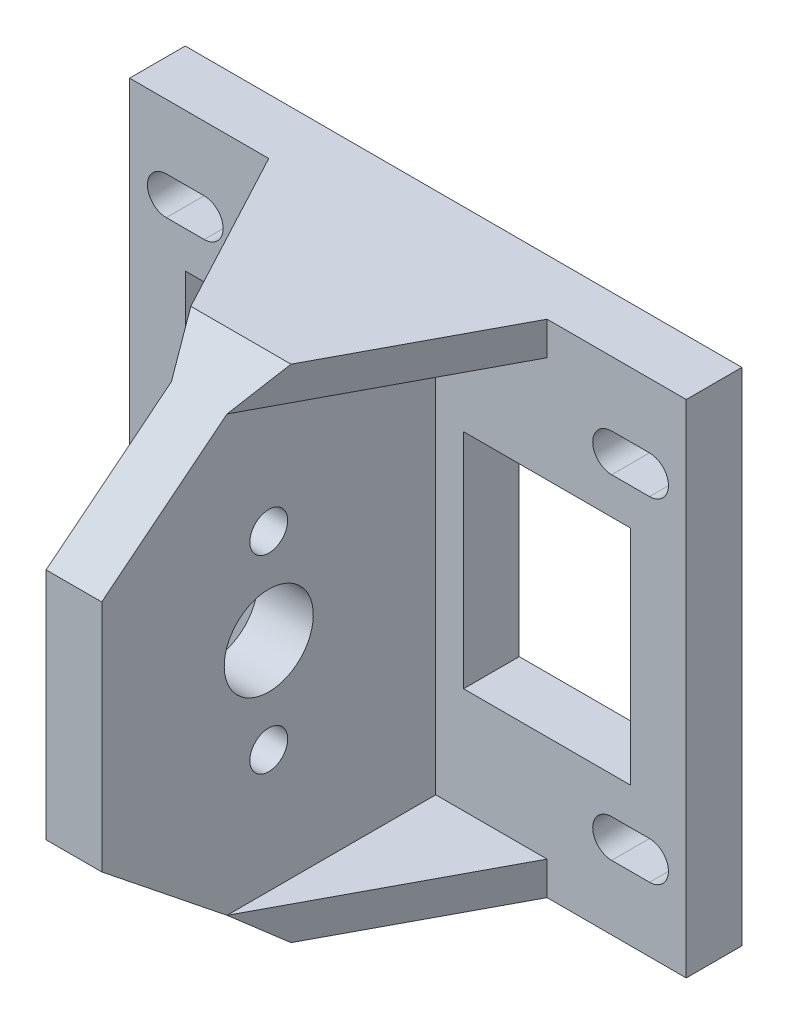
ISO-10303-21;
HEADER;
FILE_DESCRIPTION(('STEP AP214'),'2;1');
FILE_NAME('part.step','',(''),(''),'','','');
FILE_SCHEMA(('AUTOMOTIVE_DESIGN { 1 0 10303 214 1 1 1 1 }'));
ENDSEC;
DATA;
#1=APPLICATION_CONTEXT('core data for automotive mechanical design processes');
#2=APPLICATION_PROTOCOL_DEFINITION('international standard','automotive_design',2000,#1);
#3=PRODUCT_CONTEXT('',#1,'mechanical');
#4=PRODUCT('Part','Part','',(#3));
#5=PRODUCT_RELATED_PRODUCT_CATEGORY('part','',(#4));
#6=PRODUCT_DEFINITION_FORMATION('','',#4);
#7=PRODUCT_DEFINITION_CONTEXT('part definition',#1,'design');
#8=PRODUCT_DEFINITION('design','',#6,#7);
#9=PRODUCT_DEFINITION_SHAPE('','',#8);
#10=(LENGTH_UNIT() NAMED_UNIT(*) SI_UNIT(.MILLI.,.METRE.));
#11=(NAMED_UNIT(*) PLANE_ANGLE_UNIT() SI_UNIT($,.RADIAN.));
#12=(NAMED_UNIT(*) SI_UNIT($,.STERADIAN.) SOLID_ANGLE_UNIT());
#13=UNCERTAINTY_MEASURE_WITH_UNIT(LENGTH_MEASURE(1.E-05),#10,'distance_accuracy_value','');
#14=(GEOMETRIC_REPRESENTATION_CONTEXT(3) GLOBAL_UNCERTAINTY_ASSIGNED_CONTEXT((#13)) GLOBAL_UNIT_ASSIGNED_CONTEXT((#10,
#11,#12)) REPRESENTATION_CONTEXT('',''));
#15=CARTESIAN_POINT('',(0.,0.,0.));
#16=DIRECTION('',(0.,0.,1.));
#17=DIRECTION('',(1.,0.,0.));
#18=AXIS2_PLACEMENT_3D('',#15,#16,#17);
#19=CARTESIAN_POINT('',(-25.,-8.5,20.));
#20=DIRECTION('',(-1.,0.,0.));
#21=DIRECTION('',(0.,0.,1.));
#22=AXIS2_PLACEMENT_3D('',#19,#20,#21);
#23=CYLINDRICAL_SURFACE('',#22,1.69999999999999);
#24=CARTESIAN_POINT('',(2.5,-8.5,20.));
#25=DIRECTION('',(-1.,0.,0.));
#26=DIRECTION('',(0.,-1.,0.));
#27=AXIS2_PLACEMENT_3D('',#24,#25,#26);
#28=CIRCLE('',#27,1.69999999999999);
#29=CARTESIAN_POINT('',(2.5,-10.2,20.));
#30=VERTEX_POINT('',#29);
#31=EDGE_CURVE('E350',#30,#30,#28,.T.);
#32=ORIENTED_EDGE('',*,*,#31,.F.);
#33=EDGE_LOOP('',(#32));
#34=FACE_BOUND('',#33,.T.);
#35=CARTESIAN_POINT('',(-0.499999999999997,-8.5,20.));
#36=DIRECTION('',(-1.,0.,0.));
#37=DIRECTION('',(0.,-1.,0.));
#38=AXIS2_PLACEMENT_3D('',#35,#36,#37);
#39=CIRCLE('',#38,1.69999999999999);
#40=CARTESIAN_POINT('',(-0.499999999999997,-10.2,20.));
#41=VERTEX_POINT('',#40);
#42=EDGE_CURVE('E359',#41,#41,#39,.F.);
#43=ORIENTED_EDGE('',*,*,#42,.F.);
#44=EDGE_LOOP('',(#43));
#45=FACE_BOUND('',#44,.T.);
#46=ADVANCED_FACE('F34',(#34,#45),#23,.F.);
#47=CARTESIAN_POINT('',(-25.,8.5,20.));
#48=DIRECTION('',(-1.,0.,0.));
#49=DIRECTION('',(0.,0.,1.));
#50=AXIS2_PLACEMENT_3D('',#47,#48,#49);
#51=CYLINDRICAL_SURFACE('',#50,1.69999999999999);
#52=CARTESIAN_POINT('',(2.5,8.5,20.));
#53=DIRECTION('',(-1.,0.,0.));
#54=DIRECTION('',(0.,-1.,0.));
#55=AXIS2_PLACEMENT_3D('',#52,#53,#54);
#56=CIRCLE('',#55,1.69999999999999);
#57=CARTESIAN_POINT('',(2.5,6.8,20.));
#58=VERTEX_POINT('',#57);
#59=EDGE_CURVE('E346',#58,#58,#56,.T.);
#60=ORIENTED_EDGE('',*,*,#59,.F.);
#61=EDGE_LOOP('',(#60));
#62=FACE_BOUND('',#61,.T.);
#63=CARTESIAN_POINT('',(-0.5,8.5,20.));
#64=DIRECTION('',(-1.,0.,0.));
#65=DIRECTION('',(0.,-1.,0.));
#66=AXIS2_PLACEMENT_3D('',#63,#64,#65);
#67=CIRCLE('',#66,1.69999999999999);
#68=CARTESIAN_POINT('',(-0.5,6.8,20.));
#69=VERTEX_POINT('',#68);
#70=EDGE_CURVE('E354',#69,#69,#67,.F.);
#71=ORIENTED_EDGE('',*,*,#70,.F.);
#72=EDGE_LOOP('',(#71));
#73=FACE_BOUND('',#72,.T.);
#74=ADVANCED_FACE('F713',(#62,#73),#51,.F.);
#75=CARTESIAN_POINT('',(0.,0.,5.));
#76=DIRECTION('',(0.,0.,1.));
#77=DIRECTION('',(1.,0.,0.));
#78=AXIS2_PLACEMENT_3D('',#75,#76,#77);
#79=PLANE('',#78);
#80=DIRECTION('',(-1.,0.,0.));
#81=VECTOR('',#80,1.);
#82=CARTESIAN_POINT('',(20.,-10.,5.));
#83=LINE('',#82,#81);
#84=CARTESIAN_POINT('',(20.,-10.,5.));
#85=VERTEX_POINT('',#84);
#86=CARTESIAN_POINT('',(5.,-10.,5.));
#87=VERTEX_POINT('',#86);
#88=EDGE_CURVE('E540',#85,#87,#83,.T.);
#89=ORIENTED_EDGE('',*,*,#88,.T.);
#90=DIRECTION('',(0.,1.,0.));
#91=VECTOR('',#90,1.);
#92=CARTESIAN_POINT('',(5.,10.,5.));
#93=LINE('',#92,#91);
#94=CARTESIAN_POINT('',(5.,10.,5.));
#95=VERTEX_POINT('',#94);
#96=EDGE_CURVE('E552',#87,#95,#93,.T.);
#97=ORIENTED_EDGE('',*,*,#96,.T.);
#98=DIRECTION('',(1.,0.,0.));
#99=VECTOR('',#98,1.);
#100=CARTESIAN_POINT('',(20.,10.,5.));
#101=LINE('',#100,#99);
#102=CARTESIAN_POINT('',(20.,10.,5.));
#103=VERTEX_POINT('',#102);
#104=EDGE_CURVE('E550',#95,#103,#101,.T.);
#105=ORIENTED_EDGE('',*,*,#104,.T.);
#106=DIRECTION('',(0.,-1.,0.));
#107=VECTOR('',#106,1.);
#108=CARTESIAN_POINT('',(20.,10.,5.));
#109=LINE('',#108,#107);
#110=EDGE_CURVE('E357',#103,#85,#109,.T.);
#111=ORIENTED_EDGE('',*,*,#110,.T.);
#112=EDGE_LOOP('',(#89,#97,#105,#111));
#113=FACE_BOUND('',#112,.T.);
#114=DIRECTION('',(-1.,0.,0.));
#115=VECTOR('',#114,1.);
#116=CARTESIAN_POINT('',(12.5,-19.5,5.));
#117=LINE('',#116,#115);
#118=CARTESIAN_POINT('',(12.5,-19.5,5.));
#119=VERTEX_POINT('',#118);
#120=CARTESIAN_POINT('',(2.5,-19.5,5.));
#121=VERTEX_POINT('',#120);
#122=EDGE_CURVE('E309',#119,#121,#117,.T.);
#123=ORIENTED_EDGE('',*,*,#122,.F.);
#124=DIRECTION('',(0.,-1.,0.));
#125=VECTOR('',#124,1.);
#126=CARTESIAN_POINT('',(12.5,-19.5,5.));
#127=LINE('',#126,#125);
#128=CARTESIAN_POINT('',(12.5,-22.5,5.));
#129=VERTEX_POINT('',#128);
#130=EDGE_CURVE('E293',#119,#129,#127,.T.);
#131=ORIENTED_EDGE('',*,*,#130,.T.);
#132=DIRECTION('',(1.,0.,0.));
#133=VECTOR('',#132,1.);
#134=CARTESIAN_POINT('',(-25.,-22.5,5.));
#135=LINE('',#134,#133);
#136=CARTESIAN_POINT('',(25.,-22.5,5.));
#137=VERTEX_POINT('',#136);
#138=EDGE_CURVE('E306',#129,#137,#135,.T.);
#139=ORIENTED_EDGE('',*,*,#138,.T.);
#140=DIRECTION('',(0.,1.,0.));
#141=VECTOR('',#140,1.);
#142=CARTESIAN_POINT('',(25.,22.5,5.));
#143=LINE('',#142,#141);
#144=CARTESIAN_POINT('',(25.,22.5,5.));
#145=VERTEX_POINT('',#144);
#146=EDGE_CURVE('E335',#137,#145,#143,.T.);
#147=ORIENTED_EDGE('',*,*,#146,.T.);
#148=DIRECTION('',(-1.,0.,0.));
#149=VECTOR('',#148,1.);
#150=CARTESIAN_POINT('',(-25.,22.5,5.));
#151=LINE('',#150,#149);
#152=CARTESIAN_POINT('',(12.5,22.5,5.));
#153=VERTEX_POINT('',#152);
#154=EDGE_CURVE('E321',#145,#153,#151,.T.);
#155=ORIENTED_EDGE('',*,*,#154,.T.);
#156=DIRECTION('',(0.,1.,0.));
#157=VECTOR('',#156,1.);
#158=CARTESIAN_POINT('',(12.5,19.5,5.));
#159=LINE('',#158,#157);
#160=CARTESIAN_POINT('',(12.5,19.5,5.));
#161=VERTEX_POINT('',#160);
#162=EDGE_CURVE('E613',#161,#153,#159,.T.);
#163=ORIENTED_EDGE('',*,*,#162,.F.);
#164=DIRECTION('',(-1.,0.,0.));
#165=VECTOR('',#164,1.);
#166=CARTESIAN_POINT('',(12.5,19.5,5.));
#167=LINE('',#166,#165);
#168=CARTESIAN_POINT('',(2.5,19.5,5.));
#169=VERTEX_POINT('',#168);
#170=EDGE_CURVE('E607',#161,#169,#167,.T.);
#171=ORIENTED_EDGE('',*,*,#170,.T.);
#172=DIRECTION('',(0.,1.,0.));
#173=VECTOR('',#172,1.);
#174=CARTESIAN_POINT('',(2.5,22.5,5.));
#175=LINE('',#174,#173);
#176=EDGE_CURVE('E631',#121,#169,#175,.T.);
#177=ORIENTED_EDGE('',*,*,#176,.F.);
#178=EDGE_LOOP('',(#123,#131,#139,#147,#155,#163,#171,#177));
#179=FACE_BOUND('',#178,.T.);
#180=DIRECTION('',(-1.,0.,0.));
#181=VECTOR('',#180,1.);
#182=CARTESIAN_POINT('',(18.3,16.7,5.));
#183=LINE('',#182,#181);
#184=CARTESIAN_POINT('',(21.7,16.7,5.));
#185=VERTEX_POINT('',#184);
#186=CARTESIAN_POINT('',(18.3,16.7,5.));
#187=VERTEX_POINT('',#186);
#188=EDGE_CURVE('E401',#185,#187,#183,.T.);
#189=ORIENTED_EDGE('',*,*,#188,.F.);
#190=CARTESIAN_POINT('',(21.7,15.,5.));
#191=DIRECTION('',(0.,0.,1.));
#192=DIRECTION('',(1.,0.,0.));
#193=AXIS2_PLACEMENT_3D('',#190,#191,#192);
#194=CIRCLE('',#193,1.7);
#195=CARTESIAN_POINT('',(21.7,13.3,5.));
#196=VERTEX_POINT('',#195);
#197=EDGE_CURVE('E417',#196,#185,#194,.T.);
#198=ORIENTED_EDGE('',*,*,#197,.F.);
#199=DIRECTION('',(1.,0.,0.));
#200=VECTOR('',#199,1.);
#201=CARTESIAN_POINT('',(18.3,13.3,5.));
#202=LINE('',#201,#200);
#203=CARTESIAN_POINT('',(18.3,13.3,5.));
#204=VERTEX_POINT('',#203);
#205=EDGE_CURVE('E414',#204,#196,#202,.T.);
#206=ORIENTED_EDGE('',*,*,#205,.F.);
#207=CARTESIAN_POINT('',(18.3,15.,5.));
#208=DIRECTION('',(0.,0.,1.));
#209=DIRECTION('',(1.,0.,0.));
#210=AXIS2_PLACEMENT_3D('',#207,#208,#209);
#211=CIRCLE('',#210,1.7);
#212=EDGE_CURVE('E411',#187,#204,#211,.T.);
#213=ORIENTED_EDGE('',*,*,#212,.F.);
#214=EDGE_LOOP('',(#189,#198,#206,#213));
#215=FACE_BOUND('',#214,.T.);
#216=DIRECTION('',(-1.,0.,0.));
#217=VECTOR('',#216,1.);
#218=CARTESIAN_POINT('',(18.3,-13.3,5.));
#219=LINE('',#218,#217);
#220=CARTESIAN_POINT('',(21.7,-13.3,5.));
#221=VERTEX_POINT('',#220);
#222=CARTESIAN_POINT('',(18.3,-13.3,5.));
#223=VERTEX_POINT('',#222);
#224=EDGE_CURVE('E469',#221,#223,#219,.T.);
#225=ORIENTED_EDGE('',*,*,#224,.F.);
#226=CARTESIAN_POINT('',(21.7,-15.,5.));
#227=DIRECTION('',(0.,0.,1.));
#228=DIRECTION('',(1.,0.,0.));
#229=AXIS2_PLACEMENT_3D('',#226,#227,#228);
#230=CIRCLE('',#229,1.7);
#231=CARTESIAN_POINT('',(21.7,-16.7,5.));
#232=VERTEX_POINT('',#231);
#233=EDGE_CURVE('E483',#232,#221,#230,.T.);
#234=ORIENTED_EDGE('',*,*,#233,.F.);
#235=DIRECTION('',(1.,0.,0.));
#236=VECTOR('',#235,1.);
#237=CARTESIAN_POINT('',(18.3,-16.7,5.));
#238=LINE('',#237,#236);
#239=CARTESIAN_POINT('',(18.3,-16.7,5.));
#240=VERTEX_POINT('',#239);
#241=EDGE_CURVE('E481',#240,#232,#238,.T.);
#242=ORIENTED_EDGE('',*,*,#241,.F.);
#243=CARTESIAN_POINT('',(18.3,-15.,5.));
#244=DIRECTION('',(0.,0.,1.));
#245=DIRECTION('',(1.,0.,0.));
#246=AXIS2_PLACEMENT_3D('',#243,#244,#245);
#247=CIRCLE('',#246,1.7);
#248=EDGE_CURVE('E396',#223,#240,#247,.T.);
#249=ORIENTED_EDGE('',*,*,#248,.F.);
#250=EDGE_LOOP('',(#225,#234,#242,#249));
#251=FACE_BOUND('',#250,.T.);
#252=ADVANCED_FACE('F303',(#113,#179,#215,#251),#79,.T.);
#253=CARTESIAN_POINT('',(0.,0.,0.));
#254=DIRECTION('',(0.,0.,1.));
#255=DIRECTION('',(1.,0.,0.));
#256=AXIS2_PLACEMENT_3D('',#253,#254,#255);
#257=PLANE('',#256);
#258=DIRECTION('',(0.,1.,0.));
#259=VECTOR('',#258,1.);
#260=CARTESIAN_POINT('',(25.,22.5,0.));
#261=LINE('',#260,#259);
#262=CARTESIAN_POINT('',(25.,-22.5,0.));
#263=VERTEX_POINT('',#262);
#264=CARTESIAN_POINT('',(25.,22.5,0.));
#265=VERTEX_POINT('',#264);
#266=EDGE_CURVE('E325',#263,#265,#261,.T.);
#267=ORIENTED_EDGE('',*,*,#266,.F.);
#268=DIRECTION('',(1.,0.,0.));
#269=VECTOR('',#268,1.);
#270=CARTESIAN_POINT('',(-25.,-22.5,0.));
#271=LINE('',#270,#269);
#272=CARTESIAN_POINT('',(-25.,-22.5,0.));
#273=VERTEX_POINT('',#272);
#274=EDGE_CURVE('E333',#273,#263,#271,.T.);
#275=ORIENTED_EDGE('',*,*,#274,.F.);
#276=DIRECTION('',(0.,-1.,0.));
#277=VECTOR('',#276,1.);
#278=CARTESIAN_POINT('',(-25.,22.5,0.));
#279=LINE('',#278,#277);
#280=CARTESIAN_POINT('',(-25.,22.5,0.));
#281=VERTEX_POINT('',#280);
#282=EDGE_CURVE('E331',#281,#273,#279,.T.);
#283=ORIENTED_EDGE('',*,*,#282,.F.);
#284=DIRECTION('',(-1.,0.,0.));
#285=VECTOR('',#284,1.);
#286=CARTESIAN_POINT('',(-25.,22.5,0.));
#287=LINE('',#286,#285);
#288=EDGE_CURVE('E328',#265,#281,#287,.T.);
#289=ORIENTED_EDGE('',*,*,#288,.F.);
#290=EDGE_LOOP('',(#267,#275,#283,#289));
#291=FACE_BOUND('',#290,.T.);
#292=CARTESIAN_POINT('',(-18.3,-15.,0.));
#293=DIRECTION('',(0.,0.,1.));
#294=DIRECTION('',(1.,0.,0.));
#295=AXIS2_PLACEMENT_3D('',#292,#293,#294);
#296=CIRCLE('',#295,1.7);
#297=CARTESIAN_POINT('',(-18.3,-16.7,0.));
#298=VERTEX_POINT('',#297);
#299=CARTESIAN_POINT('',(-18.3,-13.3,0.));
#300=VERTEX_POINT('',#299);
#301=EDGE_CURVE('E439',#298,#300,#296,.T.);
#302=ORIENTED_EDGE('',*,*,#301,.T.);
#303=DIRECTION('',(-1.,0.,0.));
#304=VECTOR('',#303,1.);
#305=CARTESIAN_POINT('',(-21.7,-13.3,0.));
#306=LINE('',#305,#304);
#307=CARTESIAN_POINT('',(-21.7,-13.3,0.));
#308=VERTEX_POINT('',#307);
#309=EDGE_CURVE('E442',#300,#308,#306,.T.);
#310=ORIENTED_EDGE('',*,*,#309,.T.);
#311=CARTESIAN_POINT('',(-21.7,-15.,0.));
#312=DIRECTION('',(0.,0.,1.));
#313=DIRECTION('',(1.,0.,0.));
#314=AXIS2_PLACEMENT_3D('',#311,#312,#313);
#315=CIRCLE('',#314,1.7);
#316=CARTESIAN_POINT('',(-21.7,-16.7,0.));
#317=VERTEX_POINT('',#316);
#318=EDGE_CURVE('E432',#308,#317,#315,.T.);
#319=ORIENTED_EDGE('',*,*,#318,.T.);
#320=DIRECTION('',(1.,0.,0.));
#321=VECTOR('',#320,1.);
#322=CARTESIAN_POINT('',(-21.7,-16.7,0.));
#323=LINE('',#322,#321);
#324=EDGE_CURVE('E435',#317,#298,#323,.T.);
#325=ORIENTED_EDGE('',*,*,#324,.T.);
#326=EDGE_LOOP('',(#302,#310,#319,#325));
#327=FACE_BOUND('',#326,.T.);
#328=CARTESIAN_POINT('',(21.7,-15.,0.));
#329=DIRECTION('',(0.,0.,1.));
#330=DIRECTION('',(1.,0.,0.));
#331=AXIS2_PLACEMENT_3D('',#328,#329,#330);
#332=CIRCLE('',#331,1.7);
#333=CARTESIAN_POINT('',(21.7,-16.7,0.));
#334=VERTEX_POINT('',#333);
#335=CARTESIAN_POINT('',(21.7,-13.3,0.));
#336=VERTEX_POINT('',#335);
#337=EDGE_CURVE('E472',#334,#336,#332,.T.);
#338=ORIENTED_EDGE('',*,*,#337,.T.);
#339=DIRECTION('',(-1.,0.,0.));
#340=VECTOR('',#339,1.);
#341=CARTESIAN_POINT('',(18.3,-13.3,0.));
#342=LINE('',#341,#340);
#343=CARTESIAN_POINT('',(18.3,-13.3,0.));
#344=VERTEX_POINT('',#343);
#345=EDGE_CURVE('E475',#336,#344,#342,.T.);
#346=ORIENTED_EDGE('',*,*,#345,.T.);
#347=CARTESIAN_POINT('',(18.3,-15.,0.));
#348=DIRECTION('',(0.,0.,1.));
#349=DIRECTION('',(1.,0.,0.));
#350=AXIS2_PLACEMENT_3D('',#347,#348,#349);
#351=CIRCLE('',#350,1.7);
#352=CARTESIAN_POINT('',(18.3,-16.7,0.));
#353=VERTEX_POINT('',#352);
#354=EDGE_CURVE('E465',#344,#353,#351,.T.);
#355=ORIENTED_EDGE('',*,*,#354,.T.);
#356=DIRECTION('',(1.,0.,0.));
#357=VECTOR('',#356,1.);
#358=CARTESIAN_POINT('',(18.3,-16.7,0.));
#359=LINE('',#358,#357);
#360=EDGE_CURVE('E468',#353,#334,#359,.T.);
#361=ORIENTED_EDGE('',*,*,#360,.T.);
#362=EDGE_LOOP('',(#338,#346,#355,#361));
#363=FACE_BOUND('',#362,.T.);
#364=CARTESIAN_POINT('',(-18.3,15.,0.));
#365=DIRECTION('',(0.,0.,1.));
#366=DIRECTION('',(1.,0.,0.));
#367=AXIS2_PLACEMENT_3D('',#364,#365,#366);
#368=CIRCLE('',#367,1.7);
#369=CARTESIAN_POINT('',(-18.3,13.3,0.));
#370=VERTEX_POINT('',#369);
#371=CARTESIAN_POINT('',(-18.3,16.7,0.));
#372=VERTEX_POINT('',#371);
#373=EDGE_CURVE('E503',#370,#372,#368,.T.);
#374=ORIENTED_EDGE('',*,*,#373,.T.);
#375=DIRECTION('',(-1.,0.,0.));
#376=VECTOR('',#375,1.);
#377=CARTESIAN_POINT('',(-21.7,16.7,0.));
#378=LINE('',#377,#376);
#379=CARTESIAN_POINT('',(-21.7,16.7,0.));
#380=VERTEX_POINT('',#379);
#381=EDGE_CURVE('E506',#372,#380,#378,.T.);
#382=ORIENTED_EDGE('',*,*,#381,.T.);
#383=CARTESIAN_POINT('',(-21.7,15.,0.));
#384=DIRECTION('',(0.,0.,1.));
#385=DIRECTION('',(1.,0.,0.));
#386=AXIS2_PLACEMENT_3D('',#383,#384,#385);
#387=CIRCLE('',#386,1.7);
#388=CARTESIAN_POINT('',(-21.7,13.3,0.));
#389=VERTEX_POINT('',#388);
#390=EDGE_CURVE('E496',#380,#389,#387,.T.);
#391=ORIENTED_EDGE('',*,*,#390,.T.);
#392=DIRECTION('',(1.,0.,0.));
#393=VECTOR('',#392,1.);
#394=CARTESIAN_POINT('',(-21.7,13.3,0.));
#395=LINE('',#394,#393);
#396=EDGE_CURVE('E499',#389,#370,#395,.T.);
#397=ORIENTED_EDGE('',*,*,#396,.T.);
#398=EDGE_LOOP('',(#374,#382,#391,#397));
#399=FACE_BOUND('',#398,.T.);
#400=CARTESIAN_POINT('',(21.7,15.,0.));
#401=DIRECTION('',(0.,0.,1.));
#402=DIRECTION('',(1.,0.,0.));
#403=AXIS2_PLACEMENT_3D('',#400,#401,#402);
#404=CIRCLE('',#403,1.7);
#405=CARTESIAN_POINT('',(21.7,13.3,0.));
#406=VERTEX_POINT('',#405);
#407=CARTESIAN_POINT('',(21.7,16.7,0.));
#408=VERTEX_POINT('',#407);
#409=EDGE_CURVE('E404',#406,#408,#404,.T.);
#410=ORIENTED_EDGE('',*,*,#409,.T.);
#411=DIRECTION('',(-1.,0.,0.));
#412=VECTOR('',#411,1.);
#413=CARTESIAN_POINT('',(18.3,16.7,0.));
#414=LINE('',#413,#412);
#415=CARTESIAN_POINT('',(18.3,16.7,0.));
#416=VERTEX_POINT('',#415);
#417=EDGE_CURVE('E407',#408,#416,#414,.T.);
#418=ORIENTED_EDGE('',*,*,#417,.T.);
#419=CARTESIAN_POINT('',(18.3,15.,0.));
#420=DIRECTION('',(0.,0.,1.));
#421=DIRECTION('',(1.,0.,0.));
#422=AXIS2_PLACEMENT_3D('',#419,#420,#421);
#423=CIRCLE('',#422,1.7);
#424=CARTESIAN_POINT('',(18.3,13.3,0.));
#425=VERTEX_POINT('',#424);
#426=EDGE_CURVE('E397',#416,#425,#423,.T.);
#427=ORIENTED_EDGE('',*,*,#426,.T.);
#428=DIRECTION('',(1.,0.,0.));
#429=VECTOR('',#428,1.);
#430=CARTESIAN_POINT('',(18.3,13.3,0.));
#431=LINE('',#430,#429);
#432=EDGE_CURVE('E400',#425,#406,#431,.T.);
#433=ORIENTED_EDGE('',*,*,#432,.T.);
#434=EDGE_LOOP('',(#410,#418,#427,#433));
#435=FACE_BOUND('',#434,.T.);
#436=DIRECTION('',(-1.,0.,0.));
#437=VECTOR('',#436,1.);
#438=CARTESIAN_POINT('',(-20.,10.,0.));
#439=LINE('',#438,#437);
#440=CARTESIAN_POINT('',(-5.,10.,0.));
#441=VERTEX_POINT('',#440);
#442=CARTESIAN_POINT('',(-20.,10.,0.));
#443=VERTEX_POINT('',#442);
#444=EDGE_CURVE('E577',#441,#443,#439,.T.);
#445=ORIENTED_EDGE('',*,*,#444,.T.);
#446=DIRECTION('',(0.,-1.,0.));
#447=VECTOR('',#446,1.);
#448=CARTESIAN_POINT('',(-20.,10.,0.));
#449=LINE('',#448,#447);
#450=CARTESIAN_POINT('',(-20.,-10.,0.));
#451=VERTEX_POINT('',#450);
#452=EDGE_CURVE('E567',#443,#451,#449,.T.);
#453=ORIENTED_EDGE('',*,*,#452,.T.);
#454=DIRECTION('',(1.,0.,0.));
#455=VECTOR('',#454,1.);
#456=CARTESIAN_POINT('',(-20.,-10.,0.));
#457=LINE('',#456,#455);
#458=CARTESIAN_POINT('',(-5.,-10.,0.));
#459=VERTEX_POINT('',#458);
#460=EDGE_CURVE('E570',#451,#459,#457,.T.);
#461=ORIENTED_EDGE('',*,*,#460,.T.);
#462=DIRECTION('',(0.,1.,0.));
#463=VECTOR('',#462,1.);
#464=CARTESIAN_POINT('',(-5.,10.,0.));
#465=LINE('',#464,#463);
#466=EDGE_CURVE('E574',#459,#441,#465,.T.);
#467=ORIENTED_EDGE('',*,*,#466,.T.);
#468=EDGE_LOOP('',(#445,#453,#461,#467));
#469=FACE_BOUND('',#468,.T.);
#470=DIRECTION('',(0.,-1.,0.));
#471=VECTOR('',#470,1.);
#472=CARTESIAN_POINT('',(20.,10.,0.));
#473=LINE('',#472,#471);
#474=CARTESIAN_POINT('',(20.,10.,0.));
#475=VERTEX_POINT('',#474);
#476=CARTESIAN_POINT('',(20.,-10.,0.));
#477=VERTEX_POINT('',#476);
#478=EDGE_CURVE('E537',#475,#477,#473,.T.);
#479=ORIENTED_EDGE('',*,*,#478,.F.);
#480=DIRECTION('',(1.,0.,0.));
#481=VECTOR('',#480,1.);
#482=CARTESIAN_POINT('',(20.,10.,0.));
#483=LINE('',#482,#481);
#484=CARTESIAN_POINT('',(5.,10.,0.));
#485=VERTEX_POINT('',#484);
#486=EDGE_CURVE('E539',#485,#475,#483,.T.);
#487=ORIENTED_EDGE('',*,*,#486,.F.);
#488=DIRECTION('',(0.,1.,0.));
#489=VECTOR('',#488,1.);
#490=CARTESIAN_POINT('',(5.,10.,0.));
#491=LINE('',#490,#489);
#492=CARTESIAN_POINT('',(5.,-10.,0.));
#493=VERTEX_POINT('',#492);
#494=EDGE_CURVE('E542',#493,#485,#491,.T.);
#495=ORIENTED_EDGE('',*,*,#494,.F.);
#496=DIRECTION('',(-1.,0.,0.));
#497=VECTOR('',#496,1.);
#498=CARTESIAN_POINT('',(20.,-10.,0.));
#499=LINE('',#498,#497);
#500=EDGE_CURVE('E545',#477,#493,#499,.T.);
#501=ORIENTED_EDGE('',*,*,#500,.F.);
#502=EDGE_LOOP('',(#479,#487,#495,#501));
#503=FACE_BOUND('',#502,.T.);
#504=ADVANCED_FACE('F734',(#291,#327,#363,#399,#435,#469,#503),#257,.F.);
#505=CARTESIAN_POINT('',(2.5,22.5,35.));
#506=DIRECTION('',(-1.,0.,0.));
#507=DIRECTION('',(0.,-1.,0.));
#508=AXIS2_PLACEMENT_3D('',#505,#506,#507);
#509=PLANE('',#508);
#510=CARTESIAN_POINT('',(2.5,0.,20.));
#511=DIRECTION('',(1.,0.,0.));
#512=DIRECTION('',(0.,1.,0.));
#513=AXIS2_PLACEMENT_3D('',#510,#511,#512);
#514=CIRCLE('',#513,4.);
#515=CARTESIAN_POINT('',(2.5,4.,20.));
#516=VERTEX_POINT('',#515);
#517=EDGE_CURVE('E349',#516,#516,#514,.T.);
#518=ORIENTED_EDGE('',*,*,#517,.F.);
#519=EDGE_LOOP('',(#518));
#520=FACE_BOUND('',#519,.T.);
#521=ORIENTED_EDGE('',*,*,#31,.T.);
#522=EDGE_LOOP('',(#521));
#523=FACE_BOUND('',#522,.T.);
#524=ORIENTED_EDGE('',*,*,#59,.T.);
#525=EDGE_LOOP('',(#524));
#526=FACE_BOUND('',#525,.T.);
#527=DIRECTION('',(0.,0.,1.));
#528=VECTOR('',#527,1.);
#529=CARTESIAN_POINT('',(2.5,19.5,5.));
#530=LINE('',#529,#528);
#531=CARTESIAN_POINT('',(2.5,19.5,23.75));
#532=VERTEX_POINT('',#531);
#533=EDGE_CURVE('E610',#169,#532,#530,.T.);
#534=ORIENTED_EDGE('',*,*,#533,.T.);
#535=DIRECTION('',(0.,-0.624695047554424,0.78086880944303));
#536=VECTOR('',#535,1.);
#537=CARTESIAN_POINT('',(2.5,15.1829268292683,29.1463414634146));
#538=LINE('',#537,#536);
#539=CARTESIAN_POINT('',(2.50000000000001,10.5,35.));
#540=VERTEX_POINT('',#539);
#541=EDGE_CURVE('E388',#532,#540,#538,.T.);
#542=ORIENTED_EDGE('',*,*,#541,.T.);
#543=DIRECTION('',(0.,1.,0.));
#544=VECTOR('',#543,1.);
#545=CARTESIAN_POINT('',(2.5,22.5,35.));
#546=LINE('',#545,#544);
#547=CARTESIAN_POINT('',(2.50000000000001,-10.5,35.));
#548=VERTEX_POINT('',#547);
#549=EDGE_CURVE('E329',#548,#540,#546,.T.);
#550=ORIENTED_EDGE('',*,*,#549,.F.);
#551=DIRECTION('',(0.,-0.624695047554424,-0.78086880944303));
#552=VECTOR('',#551,1.);
#553=CARTESIAN_POINT('',(2.5,2.37804878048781,51.0975609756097));
#554=LINE('',#553,#552);
#555=CARTESIAN_POINT('',(2.5,-19.5,23.75));
#556=VERTEX_POINT('',#555);
#557=EDGE_CURVE('E376',#548,#556,#554,.T.);
#558=ORIENTED_EDGE('',*,*,#557,.T.);
#559=DIRECTION('',(0.,0.,1.));
#560=VECTOR('',#559,1.);
#561=CARTESIAN_POINT('',(2.5,-19.5,5.));
#562=LINE('',#561,#560);
#563=EDGE_CURVE('E311',#121,#556,#562,.T.);
#564=ORIENTED_EDGE('',*,*,#563,.F.);
#565=ORIENTED_EDGE('',*,*,#176,.T.);
#566=EDGE_LOOP('',(#534,#542,#550,#558,#564,#565));
#567=FACE_BOUND('',#566,.T.);
#568=ADVANCED_FACE('F682',(#520,#523,#526,#567),#509,.F.);
#569=DIRECTION('',(0.,1.,0.));
#570=VECTOR('',#569,1.);
#571=CARTESIAN_POINT('',(-5.,10.,5.));
#572=LINE('',#571,#570);
#573=CARTESIAN_POINT('',(-5.,-10.,5.));
#574=VERTEX_POINT('',#573);
#575=CARTESIAN_POINT('',(-5.,10.,5.));
#576=VERTEX_POINT('',#575);
#577=EDGE_CURVE('E584',#574,#576,#572,.T.);
#578=ORIENTED_EDGE('',*,*,#577,.F.);
#579=DIRECTION('',(1.,0.,0.));
#580=VECTOR('',#579,1.);
#581=CARTESIAN_POINT('',(-20.,-10.,5.));
#582=LINE('',#581,#580);
#583=CARTESIAN_POINT('',(-20.,-10.,5.));
#584=VERTEX_POINT('',#583);
#585=EDGE_CURVE('E582',#584,#574,#582,.T.);
#586=ORIENTED_EDGE('',*,*,#585,.F.);
#587=DIRECTION('',(0.,-1.,0.));
#588=VECTOR('',#587,1.);
#589=CARTESIAN_POINT('',(-20.,10.,5.));
#590=LINE('',#589,#588);
#591=CARTESIAN_POINT('',(-20.,10.,5.));
#592=VERTEX_POINT('',#591);
#593=EDGE_CURVE('E559',#592,#584,#590,.T.);
#594=ORIENTED_EDGE('',*,*,#593,.F.);
#595=DIRECTION('',(-1.,0.,0.));
#596=VECTOR('',#595,1.);
#597=CARTESIAN_POINT('',(-20.,10.,5.));
#598=LINE('',#597,#596);
#599=EDGE_CURVE('E571',#576,#592,#598,.T.);
#600=ORIENTED_EDGE('',*,*,#599,.F.);
#601=EDGE_LOOP('',(#578,#586,#594,#600));
#602=FACE_BOUND('',#601,.T.);
#603=DIRECTION('',(0.,-1.,0.));
#604=VECTOR('',#603,1.);
#605=CARTESIAN_POINT('',(-12.5,-19.5,5.));
#606=LINE('',#605,#604);
#607=CARTESIAN_POINT('',(-12.5,-19.5,5.));
#608=VERTEX_POINT('',#607);
#609=CARTESIAN_POINT('',(-12.5,-22.5,5.));
#610=VERTEX_POINT('',#609);
#611=EDGE_CURVE('E605',#608,#610,#606,.T.);
#612=ORIENTED_EDGE('',*,*,#611,.F.);
#613=DIRECTION('',(-1.,0.,0.));
#614=VECTOR('',#613,1.);
#615=CARTESIAN_POINT('',(-12.5,-19.5,5.));
#616=LINE('',#615,#614);
#617=CARTESIAN_POINT('',(-2.5,-19.5,5.));
#618=VERTEX_POINT('',#617);
#619=EDGE_CURVE('E310',#618,#608,#616,.T.);
#620=ORIENTED_EDGE('',*,*,#619,.F.);
#621=DIRECTION('',(0.,-1.,0.));
#622=VECTOR('',#621,1.);
#623=CARTESIAN_POINT('',(-2.5,22.5,5.));
#624=LINE('',#623,#622);
#625=CARTESIAN_POINT('',(-2.5,19.5,5.));
#626=VERTEX_POINT('',#625);
#627=EDGE_CURVE('E627',#626,#618,#624,.T.);
#628=ORIENTED_EDGE('',*,*,#627,.F.);
#629=DIRECTION('',(-1.,0.,0.));
#630=VECTOR('',#629,1.);
#631=CARTESIAN_POINT('',(-12.5,19.5,5.));
#632=LINE('',#631,#630);
#633=CARTESIAN_POINT('',(-12.5,19.5,5.));
#634=VERTEX_POINT('',#633);
#635=EDGE_CURVE('E617',#626,#634,#632,.T.);
#636=ORIENTED_EDGE('',*,*,#635,.T.);
#637=DIRECTION('',(0.,1.,0.));
#638=VECTOR('',#637,1.);
#639=CARTESIAN_POINT('',(-12.5,19.5,5.));
#640=LINE('',#639,#638);
#641=CARTESIAN_POINT('',(-12.5,22.5,5.));
#642=VERTEX_POINT('',#641);
#643=EDGE_CURVE('E353',#634,#642,#640,.T.);
#644=ORIENTED_EDGE('',*,*,#643,.T.);
#645=CARTESIAN_POINT('',(-25.,22.5,5.));
#646=VERTEX_POINT('',#645);
#647=EDGE_CURVE('E636',#642,#646,#151,.T.);
#648=ORIENTED_EDGE('',*,*,#647,.T.);
#649=DIRECTION('',(0.,-1.,0.));
#650=VECTOR('',#649,1.);
#651=CARTESIAN_POINT('',(-25.,22.5,5.));
#652=LINE('',#651,#650);
#653=CARTESIAN_POINT('',(-25.,-22.5,5.));
#654=VERTEX_POINT('',#653);
#655=EDGE_CURVE('E318',#646,#654,#652,.T.);
#656=ORIENTED_EDGE('',*,*,#655,.T.);
#657=EDGE_CURVE('E317',#654,#610,#135,.T.);
#658=ORIENTED_EDGE('',*,*,#657,.T.);
#659=EDGE_LOOP('',(#612,#620,#628,#636,#644,#648,#656,#658));
#660=FACE_BOUND('',#659,.T.);
#661=DIRECTION('',(-1.,0.,0.));
#662=VECTOR('',#661,1.);
#663=CARTESIAN_POINT('',(-21.7,-13.3,5.));
#664=LINE('',#663,#662);
#665=CARTESIAN_POINT('',(-18.3,-13.3,5.));
#666=VERTEX_POINT('',#665);
#667=CARTESIAN_POINT('',(-21.7,-13.3,5.));
#668=VERTEX_POINT('',#667);
#669=EDGE_CURVE('E436',#666,#668,#664,.T.);
#670=ORIENTED_EDGE('',*,*,#669,.F.);
#671=CARTESIAN_POINT('',(-18.3,-15.,5.));
#672=DIRECTION('',(0.,0.,1.));
#673=DIRECTION('',(1.,0.,0.));
#674=AXIS2_PLACEMENT_3D('',#671,#672,#673);
#675=CIRCLE('',#674,1.7);
#676=CARTESIAN_POINT('',(-18.3,-16.7,5.));
#677=VERTEX_POINT('',#676);
#678=EDGE_CURVE('E452',#677,#666,#675,.T.);
#679=ORIENTED_EDGE('',*,*,#678,.F.);
#680=DIRECTION('',(1.,0.,0.));
#681=VECTOR('',#680,1.);
#682=CARTESIAN_POINT('',(-21.7,-16.7,5.));
#683=LINE('',#682,#681);
#684=CARTESIAN_POINT('',(-21.7,-16.7,5.));
#685=VERTEX_POINT('',#684);
#686=EDGE_CURVE('E449',#685,#677,#683,.T.);
#687=ORIENTED_EDGE('',*,*,#686,.F.);
#688=CARTESIAN_POINT('',(-21.7,-15.,5.));
#689=DIRECTION('',(0.,0.,1.));
#690=DIRECTION('',(1.,0.,0.));
#691=AXIS2_PLACEMENT_3D('',#688,#689,#690);
#692=CIRCLE('',#691,1.7);
#693=EDGE_CURVE('E446',#668,#685,#692,.T.);
#694=ORIENTED_EDGE('',*,*,#693,.F.);
#695=EDGE_LOOP('',(#670,#679,#687,#694));
#696=FACE_BOUND('',#695,.T.);
#697=DIRECTION('',(-1.,0.,0.));
#698=VECTOR('',#697,1.);
#699=CARTESIAN_POINT('',(-21.7,16.7,5.));
#700=LINE('',#699,#698);
#701=CARTESIAN_POINT('',(-18.3,16.7,5.));
#702=VERTEX_POINT('',#701);
#703=CARTESIAN_POINT('',(-21.7,16.7,5.));
#704=VERTEX_POINT('',#703);
#705=EDGE_CURVE('E500',#702,#704,#700,.T.);
#706=ORIENTED_EDGE('',*,*,#705,.F.);
#707=CARTESIAN_POINT('',(-18.3,15.,5.));
#708=DIRECTION('',(0.,0.,1.));
#709=DIRECTION('',(1.,0.,0.));
#710=AXIS2_PLACEMENT_3D('',#707,#708,#709);
#711=CIRCLE('',#710,1.7);
#712=CARTESIAN_POINT('',(-18.3,13.3,5.));
#713=VERTEX_POINT('',#712);
#714=EDGE_CURVE('E514',#713,#702,#711,.T.);
#715=ORIENTED_EDGE('',*,*,#714,.F.);
#716=DIRECTION('',(1.,0.,0.));
#717=VECTOR('',#716,1.);
#718=CARTESIAN_POINT('',(-21.7,13.3,5.));
#719=LINE('',#718,#717);
#720=CARTESIAN_POINT('',(-21.7,13.3,5.));
#721=VERTEX_POINT('',#720);
#722=EDGE_CURVE('E512',#721,#713,#719,.T.);
#723=ORIENTED_EDGE('',*,*,#722,.F.);
#724=CARTESIAN_POINT('',(-21.7,15.,5.));
#725=DIRECTION('',(0.,0.,1.));
#726=DIRECTION('',(1.,0.,0.));
#727=AXIS2_PLACEMENT_3D('',#724,#725,#726);
#728=CIRCLE('',#727,1.7);
#729=EDGE_CURVE('E424',#704,#721,#728,.T.);
#730=ORIENTED_EDGE('',*,*,#729,.F.);
#731=EDGE_LOOP('',(#706,#715,#723,#730));
#732=FACE_BOUND('',#731,.T.);
#733=ADVANCED_FACE('F643',(#602,#660,#696,#732),#79,.T.);
#734=CARTESIAN_POINT('',(25.,22.5,5.));
#735=DIRECTION('',(-1.,0.,0.));
#736=DIRECTION('',(0.,-1.,0.));
#737=AXIS2_PLACEMENT_3D('',#734,#735,#736);
#738=PLANE('',#737);
#739=ORIENTED_EDGE('',*,*,#266,.T.);
#740=DIRECTION('',(0.,0.,-1.));
#741=VECTOR('',#740,1.);
#742=CARTESIAN_POINT('',(25.,22.5,5.));
#743=LINE('',#742,#741);
#744=EDGE_CURVE('E343',#145,#265,#743,.T.);
#745=ORIENTED_EDGE('',*,*,#744,.F.);
#746=ORIENTED_EDGE('',*,*,#146,.F.);
#747=DIRECTION('',(0.,0.,-1.));
#748=VECTOR('',#747,1.);
#749=CARTESIAN_POINT('',(25.,-22.5,5.));
#750=LINE('',#749,#748);
#751=EDGE_CURVE('E315',#137,#263,#750,.T.);
#752=ORIENTED_EDGE('',*,*,#751,.T.);
#753=EDGE_LOOP('',(#739,#745,#746,#752));
#754=FACE_BOUND('',#753,.T.);
#755=ADVANCED_FACE('F36',(#754),#738,.F.);
#756=CARTESIAN_POINT('',(-25.,22.5,5.));
#757=DIRECTION('',(0.,-1.,0.));
#758=DIRECTION('',(0.,0.,-1.));
#759=AXIS2_PLACEMENT_3D('',#756,#757,#758);
#760=PLANE('',#759);
#761=DIRECTION('',(1.,0.,0.));
#762=VECTOR('',#761,1.);
#763=CARTESIAN_POINT('',(-25.,22.5,20.));
#764=LINE('',#763,#762);
#765=CARTESIAN_POINT('',(-4.5,22.5,20.));
#766=VERTEX_POINT('',#765);
#767=CARTESIAN_POINT('',(4.5,22.5,20.));
#768=VERTEX_POINT('',#767);
#769=EDGE_CURVE('E385',#766,#768,#764,.T.);
#770=ORIENTED_EDGE('',*,*,#769,.T.);
#771=DIRECTION('',(-0.470588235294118,0.,0.882352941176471));
#772=VECTOR('',#771,1.);
#773=CARTESIAN_POINT('',(2.5,22.5,23.75));
#774=LINE('',#773,#772);
#775=EDGE_CURVE('E49',#153,#768,#774,.T.);
#776=ORIENTED_EDGE('',*,*,#775,.F.);
#777=ORIENTED_EDGE('',*,*,#154,.F.);
#778=ORIENTED_EDGE('',*,*,#744,.T.);
#779=ORIENTED_EDGE('',*,*,#288,.T.);
#780=DIRECTION('',(0.,0.,-1.));
#781=VECTOR('',#780,1.);
#782=CARTESIAN_POINT('',(-25.,22.5,5.));
#783=LINE('',#782,#781);
#784=EDGE_CURVE('E340',#646,#281,#783,.T.);
#785=ORIENTED_EDGE('',*,*,#784,.F.);
#786=ORIENTED_EDGE('',*,*,#647,.F.);
#787=DIRECTION('',(-0.470588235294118,0.,-0.882352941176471));
#788=VECTOR('',#787,1.);
#789=CARTESIAN_POINT('',(-2.5,22.5,23.75));
#790=LINE('',#789,#788);
#791=EDGE_CURVE('E697',#766,#642,#790,.T.);
#792=ORIENTED_EDGE('',*,*,#791,.F.);
#793=EDGE_LOOP('',(#770,#776,#777,#778,#779,#785,#786,#792));
#794=FACE_BOUND('',#793,.T.);
#795=ADVANCED_FACE('F649',(#794),#760,.F.);
#796=CARTESIAN_POINT('',(-25.,22.5,5.));
#797=DIRECTION('',(1.,0.,0.));
#798=DIRECTION('',(0.,1.,0.));
#799=AXIS2_PLACEMENT_3D('',#796,#797,#798);
#800=PLANE('',#799);
#801=ORIENTED_EDGE('',*,*,#282,.T.);
#802=DIRECTION('',(0.,0.,-1.));
#803=VECTOR('',#802,1.);
#804=CARTESIAN_POINT('',(-25.,-22.5,5.));
#805=LINE('',#804,#803);
#806=EDGE_CURVE('E337',#654,#273,#805,.T.);
#807=ORIENTED_EDGE('',*,*,#806,.F.);
#808=ORIENTED_EDGE('',*,*,#655,.F.);
#809=ORIENTED_EDGE('',*,*,#784,.T.);
#810=EDGE_LOOP('',(#801,#807,#808,#809));
#811=FACE_BOUND('',#810,.T.);
#812=ADVANCED_FACE('F652',(#811),#800,.F.);
#813=CARTESIAN_POINT('',(-25.,-22.5,5.));
#814=DIRECTION('',(0.,1.,0.));
#815=DIRECTION('',(0.,0.,1.));
#816=AXIS2_PLACEMENT_3D('',#813,#814,#815);
#817=PLANE('',#816);
#818=ORIENTED_EDGE('',*,*,#138,.F.);
#819=DIRECTION('',(-0.470588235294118,0.,0.882352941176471));
#820=VECTOR('',#819,1.);
#821=CARTESIAN_POINT('',(2.5,-22.5,23.75));
#822=LINE('',#821,#820);
#823=CARTESIAN_POINT('',(4.5,-22.5,20.));
#824=VERTEX_POINT('',#823);
#825=EDGE_CURVE('E290',#129,#824,#822,.T.);
#826=ORIENTED_EDGE('',*,*,#825,.T.);
#827=DIRECTION('',(1.,0.,0.));
#828=VECTOR('',#827,1.);
#829=CARTESIAN_POINT('',(-25.,-22.5,20.));
#830=LINE('',#829,#828);
#831=CARTESIAN_POINT('',(-4.5,-22.5,20.));
#832=VERTEX_POINT('',#831);
#833=EDGE_CURVE('E366',#832,#824,#830,.T.);
#834=ORIENTED_EDGE('',*,*,#833,.F.);
#835=DIRECTION('',(-0.470588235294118,0.,-0.882352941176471));
#836=VECTOR('',#835,1.);
#837=CARTESIAN_POINT('',(-2.5,-22.5,23.75));
#838=LINE('',#837,#836);
#839=EDGE_CURVE('E57',#832,#610,#838,.T.);
#840=ORIENTED_EDGE('',*,*,#839,.T.);
#841=ORIENTED_EDGE('',*,*,#657,.F.);
#842=ORIENTED_EDGE('',*,*,#806,.T.);
#843=ORIENTED_EDGE('',*,*,#274,.T.);
#844=ORIENTED_EDGE('',*,*,#751,.F.);
#845=EDGE_LOOP('',(#818,#826,#834,#840,#841,#842,#843,#844));
#846=FACE_BOUND('',#845,.T.);
#847=ADVANCED_FACE('F313',(#846),#817,.F.);
#848=CARTESIAN_POINT('',(-2.5,22.5,35.));
#849=DIRECTION('',(1.,0.,0.));
#850=DIRECTION('',(0.,1.,0.));
#851=AXIS2_PLACEMENT_3D('',#848,#849,#850);
#852=PLANE('',#851);
#853=CARTESIAN_POINT('',(-2.5,0.,20.));
#854=DIRECTION('',(1.,0.,0.));
#855=DIRECTION('',(0.,1.,0.));
#856=AXIS2_PLACEMENT_3D('',#853,#854,#855);
#857=CIRCLE('',#856,4.);
#858=CARTESIAN_POINT('',(-2.5,4.,20.));
#859=VERTEX_POINT('',#858);
#860=EDGE_CURVE('E624',#859,#859,#857,.T.);
#861=ORIENTED_EDGE('',*,*,#860,.T.);
#862=EDGE_LOOP('',(#861));
#863=FACE_BOUND('',#862,.T.);
#864=CARTESIAN_POINT('',(-2.5,-8.5,20.));
#865=DIRECTION('',(-1.,0.,0.));
#866=DIRECTION('',(0.,-1.,0.));
#867=AXIS2_PLACEMENT_3D('',#864,#865,#866);
#868=CIRCLE('',#867,3.);
#869=CARTESIAN_POINT('',(-2.5,-11.5,20.));
#870=VERTEX_POINT('',#869);
#871=EDGE_CURVE('E521',#870,#870,#868,.T.);
#872=ORIENTED_EDGE('',*,*,#871,.F.);
#873=EDGE_LOOP('',(#872));
#874=FACE_BOUND('',#873,.T.);
#875=CARTESIAN_POINT('',(-2.5,8.5,20.));
#876=DIRECTION('',(-1.,0.,0.));
#877=DIRECTION('',(0.,-1.,0.));
#878=AXIS2_PLACEMENT_3D('',#875,#876,#877);
#879=CIRCLE('',#878,3.);
#880=CARTESIAN_POINT('',(-2.5,5.5,20.));
#881=VERTEX_POINT('',#880);
#882=EDGE_CURVE('E361',#881,#881,#879,.T.);
#883=ORIENTED_EDGE('',*,*,#882,.F.);
#884=EDGE_LOOP('',(#883));
#885=FACE_BOUND('',#884,.T.);
#886=DIRECTION('',(0.,0.,-1.));
#887=VECTOR('',#886,1.);
#888=CARTESIAN_POINT('',(-2.5,-19.5,5.));
#889=LINE('',#888,#887);
#890=CARTESIAN_POINT('',(-2.5,-19.5,23.75));
#891=VERTEX_POINT('',#890);
#892=EDGE_CURVE('E603',#891,#618,#889,.T.);
#893=ORIENTED_EDGE('',*,*,#892,.F.);
#894=DIRECTION('',(0.,0.624695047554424,0.78086880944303));
#895=VECTOR('',#894,1.);
#896=CARTESIAN_POINT('',(-2.5,2.37804878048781,51.0975609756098));
#897=LINE('',#896,#895);
#898=CARTESIAN_POINT('',(-2.5,-10.5,35.));
#899=VERTEX_POINT('',#898);
#900=EDGE_CURVE('E368',#891,#899,#897,.T.);
#901=ORIENTED_EDGE('',*,*,#900,.T.);
#902=DIRECTION('',(0.,-1.,0.));
#903=VECTOR('',#902,1.);
#904=CARTESIAN_POINT('',(-2.5,22.5,35.));
#905=LINE('',#904,#903);
#906=CARTESIAN_POINT('',(-2.5,10.5,35.));
#907=VERTEX_POINT('',#906);
#908=EDGE_CURVE('E628',#907,#899,#905,.T.);
#909=ORIENTED_EDGE('',*,*,#908,.F.);
#910=DIRECTION('',(0.,0.624695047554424,-0.78086880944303));
#911=VECTOR('',#910,1.);
#912=CARTESIAN_POINT('',(-2.5,15.1829268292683,29.1463414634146));
#913=LINE('',#912,#911);
#914=CARTESIAN_POINT('',(-2.5,19.5,23.75));
#915=VERTEX_POINT('',#914);
#916=EDGE_CURVE('E393',#907,#915,#913,.T.);
#917=ORIENTED_EDGE('',*,*,#916,.T.);
#918=DIRECTION('',(0.,0.,-1.));
#919=VECTOR('',#918,1.);
#920=CARTESIAN_POINT('',(-2.5,19.5,5.));
#921=LINE('',#920,#919);
#922=EDGE_CURVE('E615',#915,#626,#921,.T.);
#923=ORIENTED_EDGE('',*,*,#922,.T.);
#924=ORIENTED_EDGE('',*,*,#627,.T.);
#925=EDGE_LOOP('',(#893,#901,#909,#917,#923,#924));
#926=FACE_BOUND('',#925,.T.);
#927=ADVANCED_FACE('F662',(#863,#874,#885,#926),#852,.F.);
#928=CARTESIAN_POINT('',(0.,0.,35.));
#929=DIRECTION('',(0.,0.,1.));
#930=DIRECTION('',(1.,0.,0.));
#931=AXIS2_PLACEMENT_3D('',#928,#929,#930);
#932=PLANE('',#931);
#933=DIRECTION('',(1.,0.,0.));
#934=VECTOR('',#933,1.);
#935=CARTESIAN_POINT('',(-25.,-10.5,35.));
#936=LINE('',#935,#934);
#937=EDGE_CURVE('E372',#899,#548,#936,.T.);
#938=ORIENTED_EDGE('',*,*,#937,.T.);
#939=ORIENTED_EDGE('',*,*,#549,.T.);
#940=DIRECTION('',(1.,0.,0.));
#941=VECTOR('',#940,1.);
#942=CARTESIAN_POINT('',(-25.,10.5,35.));
#943=LINE('',#942,#941);
#944=EDGE_CURVE('E384',#907,#540,#943,.T.);
#945=ORIENTED_EDGE('',*,*,#944,.F.);
#946=ORIENTED_EDGE('',*,*,#908,.T.);
#947=EDGE_LOOP('',(#938,#939,#945,#946));
#948=FACE_BOUND('',#947,.T.);
#949=ADVANCED_FACE('F679',(#948),#932,.T.);
#950=CARTESIAN_POINT('',(-25.,0.,20.));
#951=DIRECTION('',(1.,0.,0.));
#952=DIRECTION('',(0.,1.,0.));
#953=AXIS2_PLACEMENT_3D('',#950,#951,#952);
#954=CYLINDRICAL_SURFACE('',#953,4.);
#955=ORIENTED_EDGE('',*,*,#517,.T.);
#956=EDGE_LOOP('',(#955));
#957=FACE_BOUND('',#956,.T.);
#958=ORIENTED_EDGE('',*,*,#860,.F.);
#959=EDGE_LOOP('',(#958));
#960=FACE_BOUND('',#959,.T.);
#961=ADVANCED_FACE('F726',(#957,#960),#954,.F.);
#962=CARTESIAN_POINT('',(0.,19.5,0.));
#963=DIRECTION('',(0.,-1.,0.));
#964=DIRECTION('',(0.,0.,-1.));
#965=AXIS2_PLACEMENT_3D('',#962,#963,#964);
#966=PLANE('',#965);
#967=DIRECTION('',(0.470588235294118,0.,0.882352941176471));
#968=VECTOR('',#967,1.);
#969=CARTESIAN_POINT('',(-11.8079584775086,19.5,6.29757785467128));
#970=LINE('',#969,#968);
#971=EDGE_CURVE('E373',#634,#915,#970,.T.);
#972=ORIENTED_EDGE('',*,*,#971,.F.);
#973=ORIENTED_EDGE('',*,*,#635,.F.);
#974=ORIENTED_EDGE('',*,*,#922,.F.);
#975=EDGE_LOOP('',(#972,#973,#974));
#976=FACE_BOUND('',#975,.T.);
#977=ADVANCED_FACE('F668',(#976),#966,.T.);
#978=CARTESIAN_POINT('',(0.,19.5,0.));
#979=DIRECTION('',(0.,1.,0.));
#980=DIRECTION('',(0.,0.,1.));
#981=AXIS2_PLACEMENT_3D('',#978,#979,#980);
#982=PLANE('',#981);
#983=ORIENTED_EDGE('',*,*,#170,.F.);
#984=DIRECTION('',(-0.470588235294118,0.,0.882352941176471));
#985=VECTOR('',#984,1.);
#986=CARTESIAN_POINT('',(11.8079584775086,19.5,6.29757785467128));
#987=LINE('',#986,#985);
#988=EDGE_CURVE('E689',#161,#532,#987,.T.);
#989=ORIENTED_EDGE('',*,*,#988,.T.);
#990=ORIENTED_EDGE('',*,*,#533,.F.);
#991=EDGE_LOOP('',(#983,#989,#990));
#992=FACE_BOUND('',#991,.T.);
#993=ADVANCED_FACE('F688',(#992),#982,.F.);
#994=CARTESIAN_POINT('',(0.,-19.5,0.));
#995=DIRECTION('',(0.,1.,0.));
#996=DIRECTION('',(0.,0.,-1.));
#997=AXIS2_PLACEMENT_3D('',#994,#995,#996);
#998=PLANE('',#997);
#999=DIRECTION('',(-0.470588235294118,0.,-0.882352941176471));
#1000=VECTOR('',#999,1.);
#1001=CARTESIAN_POINT('',(-11.8079584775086,-19.5,6.29757785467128));
#1002=LINE('',#1001,#1000);
#1003=EDGE_CURVE('E657',#891,#608,#1002,.T.);
#1004=ORIENTED_EDGE('',*,*,#1003,.F.);
#1005=ORIENTED_EDGE('',*,*,#892,.T.);
#1006=ORIENTED_EDGE('',*,*,#619,.T.);
#1007=EDGE_LOOP('',(#1004,#1005,#1006));
#1008=FACE_BOUND('',#1007,.T.);
#1009=ADVANCED_FACE('F660',(#1008),#998,.T.);
#1010=CARTESIAN_POINT('',(0.,-19.5,0.));
#1011=DIRECTION('',(0.,-1.,0.));
#1012=DIRECTION('',(0.,0.,1.));
#1013=AXIS2_PLACEMENT_3D('',#1010,#1011,#1012);
#1014=PLANE('',#1013);
#1015=ORIENTED_EDGE('',*,*,#563,.T.);
#1016=DIRECTION('',(0.470588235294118,0.,-0.882352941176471));
#1017=VECTOR('',#1016,1.);
#1018=CARTESIAN_POINT('',(11.8079584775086,-19.5,6.29757785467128));
#1019=LINE('',#1018,#1017);
#1020=EDGE_CURVE('E299',#556,#119,#1019,.T.);
#1021=ORIENTED_EDGE('',*,*,#1020,.T.);
#1022=ORIENTED_EDGE('',*,*,#122,.T.);
#1023=EDGE_LOOP('',(#1015,#1021,#1022));
#1024=FACE_BOUND('',#1023,.T.);
#1025=ADVANCED_FACE('F700',(#1024),#1014,.F.);
#1026=CARTESIAN_POINT('',(-20.,10.,0.));
#1027=DIRECTION('',(-1.,0.,0.));
#1028=DIRECTION('',(0.,-1.,0.));
#1029=AXIS2_PLACEMENT_3D('',#1026,#1027,#1028);
#1030=PLANE('',#1029);
#1031=ORIENTED_EDGE('',*,*,#593,.T.);
#1032=DIRECTION('',(0.,0.,1.));
#1033=VECTOR('',#1032,1.);
#1034=CARTESIAN_POINT('',(-20.,-10.,0.));
#1035=LINE('',#1034,#1033);
#1036=EDGE_CURVE('E580',#451,#584,#1035,.T.);
#1037=ORIENTED_EDGE('',*,*,#1036,.F.);
#1038=ORIENTED_EDGE('',*,*,#452,.F.);
#1039=DIRECTION('',(0.,0.,1.));
#1040=VECTOR('',#1039,1.);
#1041=CARTESIAN_POINT('',(-20.,10.,0.));
#1042=LINE('',#1041,#1040);
#1043=EDGE_CURVE('E588',#443,#592,#1042,.T.);
#1044=ORIENTED_EDGE('',*,*,#1043,.T.);
#1045=EDGE_LOOP('',(#1031,#1037,#1038,#1044));
#1046=FACE_BOUND('',#1045,.T.);
#1047=ADVANCED_FACE('F702',(#1046),#1030,.F.);
#1048=CARTESIAN_POINT('',(-20.,10.,0.));
#1049=DIRECTION('',(0.,1.,0.));
#1050=DIRECTION('',(0.,0.,1.));
#1051=AXIS2_PLACEMENT_3D('',#1048,#1049,#1050);
#1052=PLANE('',#1051);
#1053=ORIENTED_EDGE('',*,*,#599,.T.);
#1054=ORIENTED_EDGE('',*,*,#1043,.F.);
#1055=ORIENTED_EDGE('',*,*,#444,.F.);
#1056=DIRECTION('',(0.,0.,1.));
#1057=VECTOR('',#1056,1.);
#1058=CARTESIAN_POINT('',(-5.,10.,0.));
#1059=LINE('',#1058,#1057);
#1060=EDGE_CURVE('E591',#441,#576,#1059,.T.);
#1061=ORIENTED_EDGE('',*,*,#1060,.T.);
#1062=EDGE_LOOP('',(#1053,#1054,#1055,#1061));
#1063=FACE_BOUND('',#1062,.T.);
#1064=ADVANCED_FACE('F708',(#1063),#1052,.F.);
#1065=CARTESIAN_POINT('',(-5.,10.,0.));
#1066=DIRECTION('',(1.,0.,0.));
#1067=DIRECTION('',(0.,1.,0.));
#1068=AXIS2_PLACEMENT_3D('',#1065,#1066,#1067);
#1069=PLANE('',#1068);
#1070=ORIENTED_EDGE('',*,*,#577,.T.);
#1071=ORIENTED_EDGE('',*,*,#1060,.F.);
#1072=ORIENTED_EDGE('',*,*,#466,.F.);
#1073=DIRECTION('',(0.,0.,1.));
#1074=VECTOR('',#1073,1.);
#1075=CARTESIAN_POINT('',(-5.,-10.,0.));
#1076=LINE('',#1075,#1074);
#1077=EDGE_CURVE('E593',#459,#574,#1076,.T.);
#1078=ORIENTED_EDGE('',*,*,#1077,.T.);
#1079=EDGE_LOOP('',(#1070,#1071,#1072,#1078));
#1080=FACE_BOUND('',#1079,.T.);
#1081=ADVANCED_FACE('F800',(#1080),#1069,.F.);
#1082=CARTESIAN_POINT('',(-20.,-10.,0.));
#1083=DIRECTION('',(0.,-1.,0.));
#1084=DIRECTION('',(0.,0.,-1.));
#1085=AXIS2_PLACEMENT_3D('',#1082,#1083,#1084);
#1086=PLANE('',#1085);
#1087=ORIENTED_EDGE('',*,*,#585,.T.);
#1088=ORIENTED_EDGE('',*,*,#1077,.F.);
#1089=ORIENTED_EDGE('',*,*,#460,.F.);
#1090=ORIENTED_EDGE('',*,*,#1036,.T.);
#1091=EDGE_LOOP('',(#1087,#1088,#1089,#1090));
#1092=FACE_BOUND('',#1091,.T.);
#1093=ADVANCED_FACE('F797',(#1092),#1086,.F.);
#1094=CARTESIAN_POINT('',(20.,10.,0.));
#1095=DIRECTION('',(-1.,0.,0.));
#1096=DIRECTION('',(0.,-1.,0.));
#1097=AXIS2_PLACEMENT_3D('',#1094,#1095,#1096);
#1098=PLANE('',#1097);
#1099=ORIENTED_EDGE('',*,*,#110,.F.);
#1100=DIRECTION('',(0.,0.,1.));
#1101=VECTOR('',#1100,1.);
#1102=CARTESIAN_POINT('',(20.,10.,0.));
#1103=LINE('',#1102,#1101);
#1104=EDGE_CURVE('E547',#475,#103,#1103,.T.);
#1105=ORIENTED_EDGE('',*,*,#1104,.F.);
#1106=ORIENTED_EDGE('',*,*,#478,.T.);
#1107=DIRECTION('',(0.,0.,1.));
#1108=VECTOR('',#1107,1.);
#1109=CARTESIAN_POINT('',(20.,-10.,0.));
#1110=LINE('',#1109,#1108);
#1111=EDGE_CURVE('E556',#477,#85,#1110,.T.);
#1112=ORIENTED_EDGE('',*,*,#1111,.T.);
#1113=EDGE_LOOP('',(#1099,#1105,#1106,#1112));
#1114=FACE_BOUND('',#1113,.T.);
#1115=ADVANCED_FACE('F774',(#1114),#1098,.T.);
#1116=CARTESIAN_POINT('',(20.,-10.,0.));
#1117=DIRECTION('',(0.,1.,0.));
#1118=DIRECTION('',(0.,0.,1.));
#1119=AXIS2_PLACEMENT_3D('',#1116,#1117,#1118);
#1120=PLANE('',#1119);
#1121=ORIENTED_EDGE('',*,*,#88,.F.);
#1122=ORIENTED_EDGE('',*,*,#1111,.F.);
#1123=ORIENTED_EDGE('',*,*,#500,.T.);
#1124=DIRECTION('',(0.,0.,1.));
#1125=VECTOR('',#1124,1.);
#1126=CARTESIAN_POINT('',(5.,-10.,0.));
#1127=LINE('',#1126,#1125);
#1128=EDGE_CURVE('E560',#493,#87,#1127,.T.);
#1129=ORIENTED_EDGE('',*,*,#1128,.T.);
#1130=EDGE_LOOP('',(#1121,#1122,#1123,#1129));
#1131=FACE_BOUND('',#1130,.T.);
#1132=ADVANCED_FACE('F776',(#1131),#1120,.T.);
#1133=CARTESIAN_POINT('',(5.,10.,0.));
#1134=DIRECTION('',(1.,0.,0.));
#1135=DIRECTION('',(0.,1.,0.));
#1136=AXIS2_PLACEMENT_3D('',#1133,#1134,#1135);
#1137=PLANE('',#1136);
#1138=ORIENTED_EDGE('',*,*,#96,.F.);
#1139=ORIENTED_EDGE('',*,*,#1128,.F.);
#1140=ORIENTED_EDGE('',*,*,#494,.T.);
#1141=DIRECTION('',(0.,0.,1.));
#1142=VECTOR('',#1141,1.);
#1143=CARTESIAN_POINT('',(5.,10.,0.));
#1144=LINE('',#1143,#1142);
#1145=EDGE_CURVE('E563',#485,#95,#1144,.T.);
#1146=ORIENTED_EDGE('',*,*,#1145,.T.);
#1147=EDGE_LOOP('',(#1138,#1139,#1140,#1146));
#1148=FACE_BOUND('',#1147,.T.);
#1149=ADVANCED_FACE('F783',(#1148),#1137,.T.);
#1150=CARTESIAN_POINT('',(20.,10.,0.));
#1151=DIRECTION('',(0.,-1.,0.));
#1152=DIRECTION('',(0.,0.,-1.));
#1153=AXIS2_PLACEMENT_3D('',#1150,#1151,#1152);
#1154=PLANE('',#1153);
#1155=ORIENTED_EDGE('',*,*,#104,.F.);
#1156=ORIENTED_EDGE('',*,*,#1145,.F.);
#1157=ORIENTED_EDGE('',*,*,#486,.T.);
#1158=ORIENTED_EDGE('',*,*,#1104,.T.);
#1159=EDGE_LOOP('',(#1155,#1156,#1157,#1158));
#1160=FACE_BOUND('',#1159,.T.);
#1161=ADVANCED_FACE('F781',(#1160),#1154,.T.);
#1162=CARTESIAN_POINT('',(-0.5,8.5,20.));
#1163=DIRECTION('',(-1.,0.,0.));
#1164=DIRECTION('',(0.,-1.,0.));
#1165=AXIS2_PLACEMENT_3D('',#1162,#1163,#1164);
#1166=PLANE('',#1165);
#1167=CARTESIAN_POINT('',(-0.5,8.5,20.));
#1168=DIRECTION('',(-1.,0.,0.));
#1169=DIRECTION('',(0.,-1.,0.));
#1170=AXIS2_PLACEMENT_3D('',#1167,#1168,#1169);
#1171=CIRCLE('',#1170,3.);
#1172=CARTESIAN_POINT('',(-0.499999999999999,5.5,20.));
#1173=VERTEX_POINT('',#1172);
#1174=EDGE_CURVE('E358',#1173,#1173,#1171,.T.);
#1175=ORIENTED_EDGE('',*,*,#1174,.T.);
#1176=EDGE_LOOP('',(#1175));
#1177=FACE_BOUND('',#1176,.T.);
#1178=ORIENTED_EDGE('',*,*,#70,.T.);
#1179=EDGE_LOOP('',(#1178));
#1180=FACE_BOUND('',#1179,.T.);
#1181=ADVANCED_FACE('F790',(#1177,#1180),#1166,.T.);
#1182=CARTESIAN_POINT('',(-0.5,8.5,20.));
#1183=DIRECTION('',(-1.,0.,0.));
#1184=DIRECTION('',(0.,-1.,0.));
#1185=AXIS2_PLACEMENT_3D('',#1182,#1183,#1184);
#1186=CYLINDRICAL_SURFACE('',#1185,3.);
#1187=ORIENTED_EDGE('',*,*,#1174,.F.);
#1188=EDGE_LOOP('',(#1187));
#1189=FACE_BOUND('',#1188,.T.);
#1190=ORIENTED_EDGE('',*,*,#882,.T.);
#1191=EDGE_LOOP('',(#1190));
#1192=FACE_BOUND('',#1191,.T.);
#1193=ADVANCED_FACE('F956',(#1189,#1192),#1186,.F.);
#1194=CARTESIAN_POINT('',(-0.499999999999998,-8.5,20.));
#1195=DIRECTION('',(-1.,0.,0.));
#1196=DIRECTION('',(0.,-1.,0.));
#1197=AXIS2_PLACEMENT_3D('',#1194,#1195,#1196);
#1198=PLANE('',#1197);
#1199=CARTESIAN_POINT('',(-0.499999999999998,-8.5,20.));
#1200=DIRECTION('',(-1.,0.,0.));
#1201=DIRECTION('',(0.,-1.,0.));
#1202=AXIS2_PLACEMENT_3D('',#1199,#1200,#1201);
#1203=CIRCLE('',#1202,3.);
#1204=CARTESIAN_POINT('',(-0.499999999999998,-11.5,20.));
#1205=VERTEX_POINT('',#1204);
#1206=EDGE_CURVE('E362',#1205,#1205,#1203,.T.);
#1207=ORIENTED_EDGE('',*,*,#1206,.T.);
#1208=EDGE_LOOP('',(#1207));
#1209=FACE_BOUND('',#1208,.T.);
#1210=ORIENTED_EDGE('',*,*,#42,.T.);
#1211=EDGE_LOOP('',(#1210));
#1212=FACE_BOUND('',#1211,.T.);
#1213=ADVANCED_FACE('F953',(#1209,#1212),#1198,.T.);
#1214=CARTESIAN_POINT('',(-0.499999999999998,-8.5,20.));
#1215=DIRECTION('',(-1.,0.,0.));
#1216=DIRECTION('',(0.,-1.,0.));
#1217=AXIS2_PLACEMENT_3D('',#1214,#1215,#1216);
#1218=CYLINDRICAL_SURFACE('',#1217,3.);
#1219=ORIENTED_EDGE('',*,*,#1206,.F.);
#1220=EDGE_LOOP('',(#1219));
#1221=FACE_BOUND('',#1220,.T.);
#1222=ORIENTED_EDGE('',*,*,#871,.T.);
#1223=EDGE_LOOP('',(#1222));
#1224=FACE_BOUND('',#1223,.T.);
#1225=ADVANCED_FACE('F941',(#1221,#1224),#1218,.F.);
#1226=CARTESIAN_POINT('',(-21.7,16.7,0.));
#1227=DIRECTION('',(0.,1.,0.));
#1228=DIRECTION('',(0.,0.,1.));
#1229=AXIS2_PLACEMENT_3D('',#1226,#1227,#1228);
#1230=PLANE('',#1229);
#1231=ORIENTED_EDGE('',*,*,#705,.T.);
#1232=DIRECTION('',(0.,0.,1.));
#1233=VECTOR('',#1232,1.);
#1234=CARTESIAN_POINT('',(-21.7,16.7,0.));
#1235=LINE('',#1234,#1233);
#1236=EDGE_CURVE('E518',#380,#704,#1235,.T.);
#1237=ORIENTED_EDGE('',*,*,#1236,.F.);
#1238=ORIENTED_EDGE('',*,*,#381,.F.);
#1239=DIRECTION('',(0.,0.,1.));
#1240=VECTOR('',#1239,1.);
#1241=CARTESIAN_POINT('',(-18.3,16.7,0.));
#1242=LINE('',#1241,#1240);
#1243=EDGE_CURVE('E522',#372,#702,#1242,.T.);
#1244=ORIENTED_EDGE('',*,*,#1243,.T.);
#1245=EDGE_LOOP('',(#1231,#1237,#1238,#1244));
#1246=FACE_BOUND('',#1245,.T.);
#1247=ADVANCED_FACE('F937',(#1246),#1230,.F.);
#1248=CARTESIAN_POINT('',(-21.7,13.3,0.));
#1249=DIRECTION('',(0.,-1.,0.));
#1250=DIRECTION('',(0.,0.,-1.));
#1251=AXIS2_PLACEMENT_3D('',#1248,#1249,#1250);
#1252=PLANE('',#1251);
#1253=ORIENTED_EDGE('',*,*,#722,.T.);
#1254=DIRECTION('',(0.,0.,1.));
#1255=VECTOR('',#1254,1.);
#1256=CARTESIAN_POINT('',(-18.3,13.3,0.));
#1257=LINE('',#1256,#1255);
#1258=EDGE_CURVE('E525',#370,#713,#1257,.T.);
#1259=ORIENTED_EDGE('',*,*,#1258,.F.);
#1260=ORIENTED_EDGE('',*,*,#396,.F.);
#1261=DIRECTION('',(0.,0.,1.));
#1262=VECTOR('',#1261,1.);
#1263=CARTESIAN_POINT('',(-21.7,13.3,0.));
#1264=LINE('',#1263,#1262);
#1265=EDGE_CURVE('E509',#389,#721,#1264,.T.);
#1266=ORIENTED_EDGE('',*,*,#1265,.T.);
#1267=EDGE_LOOP('',(#1253,#1259,#1260,#1266));
#1268=FACE_BOUND('',#1267,.T.);
#1269=ADVANCED_FACE('F940',(#1268),#1252,.F.);
#1270=CARTESIAN_POINT('',(-21.7,15.,0.));
#1271=DIRECTION('',(0.,0.,1.));
#1272=DIRECTION('',(1.,0.,0.));
#1273=AXIS2_PLACEMENT_3D('',#1270,#1271,#1272);
#1274=CYLINDRICAL_SURFACE('',#1273,1.7);
#1275=ORIENTED_EDGE('',*,*,#729,.T.);
#1276=ORIENTED_EDGE('',*,*,#1265,.F.);
#1277=ORIENTED_EDGE('',*,*,#390,.F.);
#1278=ORIENTED_EDGE('',*,*,#1236,.T.);
#1279=EDGE_LOOP('',(#1275,#1276,#1277,#1278));
#1280=FACE_BOUND('',#1279,.T.);
#1281=ADVANCED_FACE('F945',(#1280),#1274,.F.);
#1282=CARTESIAN_POINT('',(-18.3,15.,0.));
#1283=DIRECTION('',(0.,0.,1.));
#1284=DIRECTION('',(1.,0.,0.));
#1285=AXIS2_PLACEMENT_3D('',#1282,#1283,#1284);
#1286=CYLINDRICAL_SURFACE('',#1285,1.7);
#1287=ORIENTED_EDGE('',*,*,#714,.T.);
#1288=ORIENTED_EDGE('',*,*,#1243,.F.);
#1289=ORIENTED_EDGE('',*,*,#373,.F.);
#1290=ORIENTED_EDGE('',*,*,#1258,.T.);
#1291=EDGE_LOOP('',(#1287,#1288,#1289,#1290));
#1292=FACE_BOUND('',#1291,.T.);
#1293=ADVANCED_FACE('F909',(#1292),#1286,.F.);
#1294=CARTESIAN_POINT('',(-21.7,-13.3,0.));
#1295=DIRECTION('',(0.,1.,0.));
#1296=DIRECTION('',(0.,0.,1.));
#1297=AXIS2_PLACEMENT_3D('',#1294,#1295,#1296);
#1298=PLANE('',#1297);
#1299=ORIENTED_EDGE('',*,*,#669,.T.);
#1300=DIRECTION('',(0.,0.,1.));
#1301=VECTOR('',#1300,1.);
#1302=CARTESIAN_POINT('',(-21.7,-13.3,0.));
#1303=LINE('',#1302,#1301);
#1304=EDGE_CURVE('E415',#308,#668,#1303,.T.);
#1305=ORIENTED_EDGE('',*,*,#1304,.F.);
#1306=ORIENTED_EDGE('',*,*,#309,.F.);
#1307=DIRECTION('',(0.,0.,1.));
#1308=VECTOR('',#1307,1.);
#1309=CARTESIAN_POINT('',(-18.3,-13.3,0.));
#1310=LINE('',#1309,#1308);
#1311=EDGE_CURVE('E458',#300,#666,#1310,.T.);
#1312=ORIENTED_EDGE('',*,*,#1311,.T.);
#1313=EDGE_LOOP('',(#1299,#1305,#1306,#1312));
#1314=FACE_BOUND('',#1313,.T.);
#1315=ADVANCED_FACE('F905',(#1314),#1298,.F.);
#1316=CARTESIAN_POINT('',(-21.7,-16.7,0.));
#1317=DIRECTION('',(0.,-1.,0.));
#1318=DIRECTION('',(0.,0.,-1.));
#1319=AXIS2_PLACEMENT_3D('',#1316,#1317,#1318);
#1320=PLANE('',#1319);
#1321=ORIENTED_EDGE('',*,*,#686,.T.);
#1322=DIRECTION('',(0.,0.,1.));
#1323=VECTOR('',#1322,1.);
#1324=CARTESIAN_POINT('',(-18.3,-16.7,0.));
#1325=LINE('',#1324,#1323);
#1326=EDGE_CURVE('E461',#298,#677,#1325,.T.);
#1327=ORIENTED_EDGE('',*,*,#1326,.F.);
#1328=ORIENTED_EDGE('',*,*,#324,.F.);
#1329=DIRECTION('',(0.,0.,1.));
#1330=VECTOR('',#1329,1.);
#1331=CARTESIAN_POINT('',(-21.7,-16.7,0.));
#1332=LINE('',#1331,#1330);
#1333=EDGE_CURVE('E445',#317,#685,#1332,.T.);
#1334=ORIENTED_EDGE('',*,*,#1333,.T.);
#1335=EDGE_LOOP('',(#1321,#1327,#1328,#1334));
#1336=FACE_BOUND('',#1335,.T.);
#1337=ADVANCED_FACE('F908',(#1336),#1320,.F.);
#1338=CARTESIAN_POINT('',(-21.7,-15.,0.));
#1339=DIRECTION('',(0.,0.,1.));
#1340=DIRECTION('',(1.,0.,0.));
#1341=AXIS2_PLACEMENT_3D('',#1338,#1339,#1340);
#1342=CYLINDRICAL_SURFACE('',#1341,1.7);
#1343=ORIENTED_EDGE('',*,*,#693,.T.);
#1344=ORIENTED_EDGE('',*,*,#1333,.F.);
#1345=ORIENTED_EDGE('',*,*,#318,.F.);
#1346=ORIENTED_EDGE('',*,*,#1304,.T.);
#1347=EDGE_LOOP('',(#1343,#1344,#1345,#1346));
#1348=FACE_BOUND('',#1347,.T.);
#1349=ADVANCED_FACE('F915',(#1348),#1342,.F.);
#1350=CARTESIAN_POINT('',(-18.3,-15.,0.));
#1351=DIRECTION('',(0.,0.,1.));
#1352=DIRECTION('',(1.,0.,0.));
#1353=AXIS2_PLACEMENT_3D('',#1350,#1351,#1352);
#1354=CYLINDRICAL_SURFACE('',#1353,1.7);
#1355=ORIENTED_EDGE('',*,*,#678,.T.);
#1356=ORIENTED_EDGE('',*,*,#1311,.F.);
#1357=ORIENTED_EDGE('',*,*,#301,.F.);
#1358=ORIENTED_EDGE('',*,*,#1326,.T.);
#1359=EDGE_LOOP('',(#1355,#1356,#1357,#1358));
#1360=FACE_BOUND('',#1359,.T.);
#1361=ADVANCED_FACE('F911',(#1360),#1354,.F.);
#1362=CARTESIAN_POINT('',(18.3,-13.3,0.));
#1363=DIRECTION('',(0.,1.,0.));
#1364=DIRECTION('',(0.,0.,1.));
#1365=AXIS2_PLACEMENT_3D('',#1362,#1363,#1364);
#1366=PLANE('',#1365);
#1367=ORIENTED_EDGE('',*,*,#224,.T.);
#1368=DIRECTION('',(0.,0.,1.));
#1369=VECTOR('',#1368,1.);
#1370=CARTESIAN_POINT('',(18.3,-13.3,0.));
#1371=LINE('',#1370,#1369);
#1372=EDGE_CURVE('E450',#344,#223,#1371,.T.);
#1373=ORIENTED_EDGE('',*,*,#1372,.F.);
#1374=ORIENTED_EDGE('',*,*,#345,.F.);
#1375=DIRECTION('',(0.,0.,1.));
#1376=VECTOR('',#1375,1.);
#1377=CARTESIAN_POINT('',(21.7,-13.3,0.));
#1378=LINE('',#1377,#1376);
#1379=EDGE_CURVE('E489',#336,#221,#1378,.T.);
#1380=ORIENTED_EDGE('',*,*,#1379,.T.);
#1381=EDGE_LOOP('',(#1367,#1373,#1374,#1380));
#1382=FACE_BOUND('',#1381,.T.);
#1383=ADVANCED_FACE('F914',(#1382),#1366,.F.);
#1384=CARTESIAN_POINT('',(18.3,-16.7,0.));
#1385=DIRECTION('',(0.,-1.,0.));
#1386=DIRECTION('',(0.,0.,-1.));
#1387=AXIS2_PLACEMENT_3D('',#1384,#1385,#1386);
#1388=PLANE('',#1387);
#1389=ORIENTED_EDGE('',*,*,#241,.T.);
#1390=DIRECTION('',(0.,0.,1.));
#1391=VECTOR('',#1390,1.);
#1392=CARTESIAN_POINT('',(21.7,-16.7,0.));
#1393=LINE('',#1392,#1391);
#1394=EDGE_CURVE('E492',#334,#232,#1393,.T.);
#1395=ORIENTED_EDGE('',*,*,#1394,.F.);
#1396=ORIENTED_EDGE('',*,*,#360,.F.);
#1397=DIRECTION('',(0.,0.,1.));
#1398=VECTOR('',#1397,1.);
#1399=CARTESIAN_POINT('',(18.3,-16.7,0.));
#1400=LINE('',#1399,#1398);
#1401=EDGE_CURVE('E478',#353,#240,#1400,.T.);
#1402=ORIENTED_EDGE('',*,*,#1401,.T.);
#1403=EDGE_LOOP('',(#1389,#1395,#1396,#1402));
#1404=FACE_BOUND('',#1403,.T.);
#1405=ADVANCED_FACE('F925',(#1404),#1388,.F.);
#1406=CARTESIAN_POINT('',(18.3,-15.,0.));
#1407=DIRECTION('',(0.,0.,1.));
#1408=DIRECTION('',(1.,0.,0.));
#1409=AXIS2_PLACEMENT_3D('',#1406,#1407,#1408);
#1410=CYLINDRICAL_SURFACE('',#1409,1.7);
#1411=ORIENTED_EDGE('',*,*,#248,.T.);
#1412=ORIENTED_EDGE('',*,*,#1401,.F.);
#1413=ORIENTED_EDGE('',*,*,#354,.F.);
#1414=ORIENTED_EDGE('',*,*,#1372,.T.);
#1415=EDGE_LOOP('',(#1411,#1412,#1413,#1414));
#1416=FACE_BOUND('',#1415,.T.);
#1417=ADVANCED_FACE('F929',(#1416),#1410,.F.);
#1418=CARTESIAN_POINT('',(21.7,-15.,0.));
#1419=DIRECTION('',(0.,0.,1.));
#1420=DIRECTION('',(1.,0.,0.));
#1421=AXIS2_PLACEMENT_3D('',#1418,#1419,#1420);
#1422=CYLINDRICAL_SURFACE('',#1421,1.7);
#1423=ORIENTED_EDGE('',*,*,#233,.T.);
#1424=ORIENTED_EDGE('',*,*,#1379,.F.);
#1425=ORIENTED_EDGE('',*,*,#337,.F.);
#1426=ORIENTED_EDGE('',*,*,#1394,.T.);
#1427=EDGE_LOOP('',(#1423,#1424,#1425,#1426));
#1428=FACE_BOUND('',#1427,.T.);
#1429=ADVANCED_FACE('F894',(#1428),#1422,.F.);
#1430=CARTESIAN_POINT('',(18.3,16.7,0.));
#1431=DIRECTION('',(0.,1.,0.));
#1432=DIRECTION('',(0.,0.,1.));
#1433=AXIS2_PLACEMENT_3D('',#1430,#1431,#1432);
#1434=PLANE('',#1433);
#1435=ORIENTED_EDGE('',*,*,#188,.T.);
#1436=DIRECTION('',(0.,0.,1.));
#1437=VECTOR('',#1436,1.);
#1438=CARTESIAN_POINT('',(18.3,16.7,0.));
#1439=LINE('',#1438,#1437);
#1440=EDGE_CURVE('E421',#416,#187,#1439,.T.);
#1441=ORIENTED_EDGE('',*,*,#1440,.F.);
#1442=ORIENTED_EDGE('',*,*,#417,.F.);
#1443=DIRECTION('',(0.,0.,1.));
#1444=VECTOR('',#1443,1.);
#1445=CARTESIAN_POINT('',(21.7,16.7,0.));
#1446=LINE('',#1445,#1444);
#1447=EDGE_CURVE('E425',#408,#185,#1446,.T.);
#1448=ORIENTED_EDGE('',*,*,#1447,.T.);
#1449=EDGE_LOOP('',(#1435,#1441,#1442,#1448));
#1450=FACE_BOUND('',#1449,.T.);
#1451=ADVANCED_FACE('F890',(#1450),#1434,.F.);
#1452=CARTESIAN_POINT('',(18.3,13.3,0.));
#1453=DIRECTION('',(0.,-1.,0.));
#1454=DIRECTION('',(0.,0.,-1.));
#1455=AXIS2_PLACEMENT_3D('',#1452,#1453,#1454);
#1456=PLANE('',#1455);
#1457=ORIENTED_EDGE('',*,*,#205,.T.);
#1458=DIRECTION('',(0.,0.,1.));
#1459=VECTOR('',#1458,1.);
#1460=CARTESIAN_POINT('',(21.7,13.3,0.));
#1461=LINE('',#1460,#1459);
#1462=EDGE_CURVE('E428',#406,#196,#1461,.T.);
#1463=ORIENTED_EDGE('',*,*,#1462,.F.);
#1464=ORIENTED_EDGE('',*,*,#432,.F.);
#1465=DIRECTION('',(0.,0.,1.));
#1466=VECTOR('',#1465,1.);
#1467=CARTESIAN_POINT('',(18.3,13.3,0.));
#1468=LINE('',#1467,#1466);
#1469=EDGE_CURVE('E410',#425,#204,#1468,.T.);
#1470=ORIENTED_EDGE('',*,*,#1469,.T.);
#1471=EDGE_LOOP('',(#1457,#1463,#1464,#1470));
#1472=FACE_BOUND('',#1471,.T.);
#1473=ADVANCED_FACE('F893',(#1472),#1456,.F.);
#1474=CARTESIAN_POINT('',(18.3,15.,0.));
#1475=DIRECTION('',(0.,0.,1.));
#1476=DIRECTION('',(1.,0.,0.));
#1477=AXIS2_PLACEMENT_3D('',#1474,#1475,#1476);
#1478=CYLINDRICAL_SURFACE('',#1477,1.7);
#1479=ORIENTED_EDGE('',*,*,#212,.T.);
#1480=ORIENTED_EDGE('',*,*,#1469,.F.);
#1481=ORIENTED_EDGE('',*,*,#426,.F.);
#1482=ORIENTED_EDGE('',*,*,#1440,.T.);
#1483=EDGE_LOOP('',(#1479,#1480,#1481,#1482));
#1484=FACE_BOUND('',#1483,.T.);
#1485=ADVANCED_FACE('F897',(#1484),#1478,.F.);
#1486=CARTESIAN_POINT('',(21.7,15.,0.));
#1487=DIRECTION('',(0.,0.,1.));
#1488=DIRECTION('',(1.,0.,0.));
#1489=AXIS2_PLACEMENT_3D('',#1486,#1487,#1488);
#1490=CYLINDRICAL_SURFACE('',#1489,1.7);
#1491=ORIENTED_EDGE('',*,*,#197,.T.);
#1492=ORIENTED_EDGE('',*,*,#1447,.F.);
#1493=ORIENTED_EDGE('',*,*,#409,.F.);
#1494=ORIENTED_EDGE('',*,*,#1462,.T.);
#1495=EDGE_LOOP('',(#1491,#1492,#1493,#1494));
#1496=FACE_BOUND('',#1495,.T.);
#1497=ADVANCED_FACE('F845',(#1496),#1490,.F.);
#1498=CARTESIAN_POINT('',(-25.,10.5,35.));
#1499=DIRECTION('',(0.,-0.78086880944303,-0.624695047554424));
#1500=DIRECTION('',(0.,0.624695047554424,-0.78086880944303));
#1501=AXIS2_PLACEMENT_3D('',#1498,#1499,#1500);
#1502=PLANE('',#1501);
#1503=ORIENTED_EDGE('',*,*,#541,.F.);
#1504=DIRECTION('',(0.38445546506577,0.576683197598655,-0.720853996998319));
#1505=VECTOR('',#1504,1.);
#1506=CARTESIAN_POINT('',(-6.67782909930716,5.73325635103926,40.9584295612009));
#1507=LINE('',#1506,#1505);
#1508=EDGE_CURVE('E694',#532,#768,#1507,.T.);
#1509=ORIENTED_EDGE('',*,*,#1508,.T.);
#1510=ORIENTED_EDGE('',*,*,#769,.F.);
#1511=DIRECTION('',(0.38445546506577,-0.576683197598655,0.720853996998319));
#1512=VECTOR('',#1511,1.);
#1513=CARTESIAN_POINT('',(-0.712471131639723,16.8187066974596,27.1016166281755));
#1514=LINE('',#1513,#1512);
#1515=EDGE_CURVE('E378',#766,#915,#1514,.T.);
#1516=ORIENTED_EDGE('',*,*,#1515,.T.);
#1517=ORIENTED_EDGE('',*,*,#916,.F.);
#1518=ORIENTED_EDGE('',*,*,#944,.T.);
#1519=EDGE_LOOP('',(#1503,#1509,#1510,#1516,#1517,#1518));
#1520=FACE_BOUND('',#1519,.T.);
#1521=ADVANCED_FACE('F675',(#1520),#1502,.F.);
#1522=CARTESIAN_POINT('',(-25.,-10.5,35.));
#1523=DIRECTION('',(0.,0.78086880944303,-0.624695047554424));
#1524=DIRECTION('',(0.,0.624695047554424,0.78086880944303));
#1525=AXIS2_PLACEMENT_3D('',#1522,#1523,#1524);
#1526=PLANE('',#1525);
#1527=ORIENTED_EDGE('',*,*,#833,.T.);
#1528=DIRECTION('',(-0.38445546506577,0.576683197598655,0.720853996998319));
#1529=VECTOR('',#1528,1.);
#1530=CARTESIAN_POINT('',(-6.67782909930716,-5.73325635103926,40.9584295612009));
#1531=LINE('',#1530,#1529);
#1532=EDGE_CURVE('E11',#824,#556,#1531,.T.);
#1533=ORIENTED_EDGE('',*,*,#1532,.T.);
#1534=ORIENTED_EDGE('',*,*,#557,.F.);
#1535=ORIENTED_EDGE('',*,*,#937,.F.);
#1536=ORIENTED_EDGE('',*,*,#900,.F.);
#1537=DIRECTION('',(-0.38445546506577,-0.576683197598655,-0.720853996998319));
#1538=VECTOR('',#1537,1.);
#1539=CARTESIAN_POINT('',(-0.712471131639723,-16.8187066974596,27.1016166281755));
#1540=LINE('',#1539,#1538);
#1541=EDGE_CURVE('E42',#891,#832,#1540,.T.);
#1542=ORIENTED_EDGE('',*,*,#1541,.T.);
#1543=EDGE_LOOP('',(#1527,#1533,#1534,#1535,#1536,#1542));
#1544=FACE_BOUND('',#1543,.T.);
#1545=ADVANCED_FACE('F365',(#1544),#1526,.F.);
#1546=CARTESIAN_POINT('',(-2.5,-22.5,23.75));
#1547=DIRECTION('',(0.88235294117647,0.,-0.470588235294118));
#1548=DIRECTION('',(-0.470588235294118,0.,-0.882352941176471));
#1549=AXIS2_PLACEMENT_3D('',#1546,#1547,#1548);
#1550=PLANE('',#1549);
#1551=ORIENTED_EDGE('',*,*,#1003,.T.);
#1552=ORIENTED_EDGE('',*,*,#611,.T.);
#1553=ORIENTED_EDGE('',*,*,#839,.F.);
#1554=ORIENTED_EDGE('',*,*,#1541,.F.);
#1555=EDGE_LOOP('',(#1551,#1552,#1553,#1554));
#1556=FACE_BOUND('',#1555,.T.);
#1557=ADVANCED_FACE('F656',(#1556),#1550,.F.);
#1558=ORIENTED_EDGE('',*,*,#971,.T.);
#1559=ORIENTED_EDGE('',*,*,#1515,.F.);
#1560=ORIENTED_EDGE('',*,*,#791,.T.);
#1561=ORIENTED_EDGE('',*,*,#643,.F.);
#1562=EDGE_LOOP('',(#1558,#1559,#1560,#1561));
#1563=FACE_BOUND('',#1562,.T.);
#1564=ADVANCED_FACE('F671',(#1563),#1550,.F.);
#1565=CARTESIAN_POINT('',(2.5,-22.5,23.75));
#1566=DIRECTION('',(-0.88235294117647,0.,-0.470588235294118));
#1567=DIRECTION('',(-0.470588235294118,0.,0.882352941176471));
#1568=AXIS2_PLACEMENT_3D('',#1565,#1566,#1567);
#1569=PLANE('',#1568);
#1570=ORIENTED_EDGE('',*,*,#1532,.F.);
#1571=ORIENTED_EDGE('',*,*,#825,.F.);
#1572=ORIENTED_EDGE('',*,*,#130,.F.);
#1573=ORIENTED_EDGE('',*,*,#1020,.F.);
#1574=EDGE_LOOP('',(#1570,#1571,#1572,#1573));
#1575=FACE_BOUND('',#1574,.T.);
#1576=ADVANCED_FACE('F292',(#1575),#1569,.F.);
#1577=ORIENTED_EDGE('',*,*,#162,.T.);
#1578=ORIENTED_EDGE('',*,*,#775,.T.);
#1579=ORIENTED_EDGE('',*,*,#1508,.F.);
#1580=ORIENTED_EDGE('',*,*,#988,.F.);
#1581=EDGE_LOOP('',(#1577,#1578,#1579,#1580));
#1582=FACE_BOUND('',#1581,.T.);
#1583=ADVANCED_FACE('F690',(#1582),#1569,.F.);
#1584=CLOSED_SHELL('',(#46,#74,#252,#504,#568,#733,#755,#795,#812,#847,#927,#949,#961,#977,#993,
#1009,#1025,#1047,#1064,#1081,#1093,#1115,#1132,#1149,#1161,#1181,#1193,#1213,#1225,#1247,#1269,
#1281,#1293,#1315,#1337,#1349,#1361,#1383,#1405,#1417,#1429,#1451,#1473,#1485,#1497,#1521,#1545,
#1557,#1564,#1576,#1583));
#1585=MANIFOLD_SOLID_BREP('B2',#1584);
#1586=ADVANCED_BREP_SHAPE_REPRESENTATION('',(#18,#1585),#14);
#1587=SHAPE_DEFINITION_REPRESENTATION(#9,#1586);
ENDSEC;
END-ISO-10303-21;
